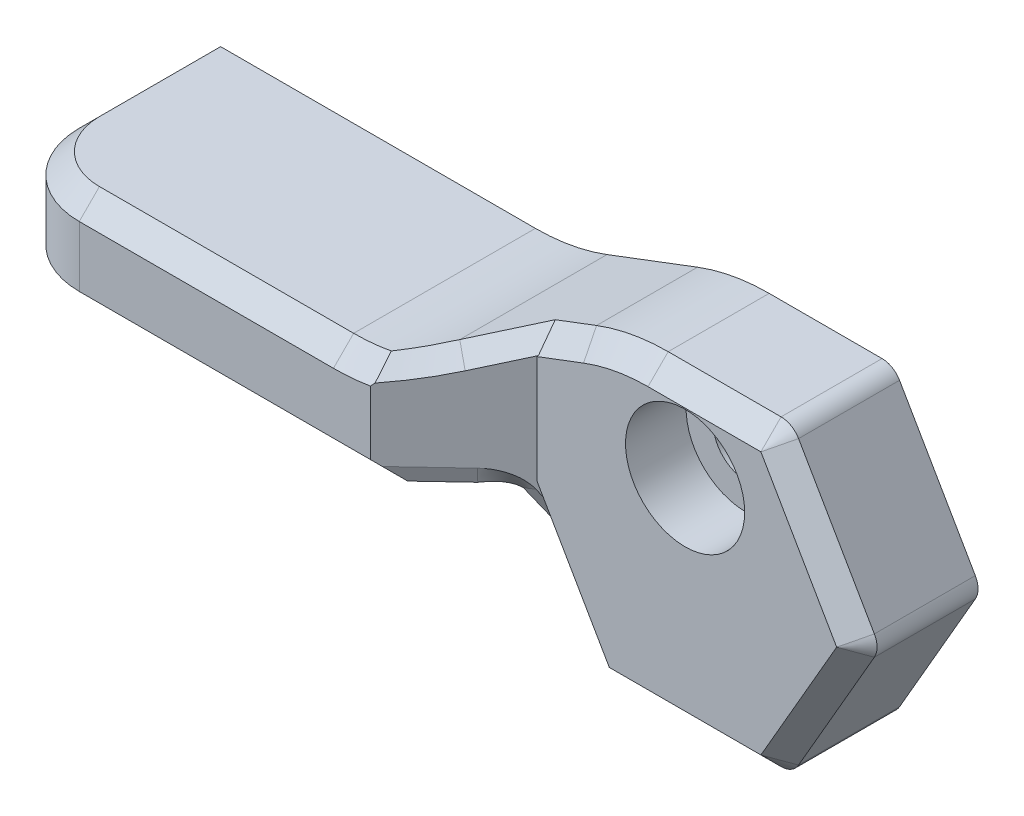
ISO-10303-21;
HEADER;
FILE_DESCRIPTION(('STEP AP214'),'2;1');
FILE_NAME('part.step','',(''),(''),'','','');
FILE_SCHEMA(('AUTOMOTIVE_DESIGN { 1 0 10303 214 1 1 1 1 }'));
ENDSEC;
DATA;
#1=APPLICATION_CONTEXT('core data for automotive mechanical design processes');
#2=APPLICATION_PROTOCOL_DEFINITION('international standard','automotive_design',2000,#1);
#3=PRODUCT_CONTEXT('',#1,'mechanical');
#4=PRODUCT('Part','Part','',(#3));
#5=PRODUCT_RELATED_PRODUCT_CATEGORY('part','',(#4));
#6=PRODUCT_DEFINITION_FORMATION('','',#4);
#7=PRODUCT_DEFINITION_CONTEXT('part definition',#1,'design');
#8=PRODUCT_DEFINITION('design','',#6,#7);
#9=PRODUCT_DEFINITION_SHAPE('','',#8);
#10=(LENGTH_UNIT() NAMED_UNIT(*) SI_UNIT(.MILLI.,.METRE.));
#11=(NAMED_UNIT(*) PLANE_ANGLE_UNIT() SI_UNIT($,.RADIAN.));
#12=(NAMED_UNIT(*) SI_UNIT($,.STERADIAN.) SOLID_ANGLE_UNIT());
#13=UNCERTAINTY_MEASURE_WITH_UNIT(LENGTH_MEASURE(1.E-05),#10,'distance_accuracy_value','');
#14=(GEOMETRIC_REPRESENTATION_CONTEXT(3) GLOBAL_UNCERTAINTY_ASSIGNED_CONTEXT((#13)) GLOBAL_UNIT_ASSIGNED_CONTEXT((#10,
#11,#12)) REPRESENTATION_CONTEXT('',''));
#15=CARTESIAN_POINT('',(0.,0.,0.));
#16=DIRECTION('',(0.,0.,1.));
#17=DIRECTION('',(1.,0.,0.));
#18=AXIS2_PLACEMENT_3D('',#15,#16,#17);
#19=CARTESIAN_POINT('',(0.,3.5,0.));
#20=DIRECTION('',(0.,0.,1.));
#21=DIRECTION('',(1.,0.,0.));
#22=AXIS2_PLACEMENT_3D('',#19,#20,#21);
#23=CYLINDRICAL_SURFACE('',#22,1.6);
#24=CARTESIAN_POINT('',(0.,3.5,0.));
#25=DIRECTION('',(0.,0.,1.));
#26=DIRECTION('',(1.,0.,0.));
#27=AXIS2_PLACEMENT_3D('',#24,#25,#26);
#28=CIRCLE('',#27,1.6);
#29=CARTESIAN_POINT('',(1.6,3.5,0.));
#30=VERTEX_POINT('',#29);
#31=EDGE_CURVE('E721',#30,#30,#28,.T.);
#32=ORIENTED_EDGE('',*,*,#31,.F.);
#33=EDGE_LOOP('',(#32));
#34=FACE_BOUND('',#33,.T.);
#35=CARTESIAN_POINT('',(0.,3.5,3.));
#36=DIRECTION('',(0.,0.,1.));
#37=DIRECTION('',(1.,0.,0.));
#38=AXIS2_PLACEMENT_3D('',#35,#36,#37);
#39=CIRCLE('',#38,1.6);
#40=CARTESIAN_POINT('',(1.6,3.5,3.));
#41=VERTEX_POINT('',#40);
#42=EDGE_CURVE('E726',#41,#41,#39,.F.);
#43=ORIENTED_EDGE('',*,*,#42,.F.);
#44=EDGE_LOOP('',(#43));
#45=FACE_BOUND('',#44,.T.);
#46=ADVANCED_FACE('F34',(#34,#45),#23,.F.);
#47=CARTESIAN_POINT('',(-11.5799906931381,4.5,10.));
#48=DIRECTION('',(0.35461398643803,-0.935012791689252,0.));
#49=DIRECTION('',(0.935012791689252,0.35461398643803,0.));
#50=AXIS2_PLACEMENT_3D('',#47,#48,#49);
#51=PLANE('',#50);
#52=DIRECTION('',(0.,0.,-1.));
#53=VECTOR('',#52,1.);
#54=CARTESIAN_POINT('',(-9.86646913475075,5.14987208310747,10.));
#55=LINE('',#54,#53);
#56=CARTESIAN_POINT('',(-9.86646913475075,5.14987208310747,0.));
#57=VERTEX_POINT('',#56);
#58=CARTESIAN_POINT('',(-9.86646913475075,5.14987208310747,7.29076062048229));
#59=VERTEX_POINT('',#58);
#60=EDGE_CURVE('E673',#57,#59,#55,.F.);
#61=ORIENTED_EDGE('',*,*,#60,.T.);
#62=DIRECTION('',(0.702167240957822,0.266304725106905,-0.660335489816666));
#63=VECTOR('',#62,1.);
#64=CARTESIAN_POINT('',(-12.0890037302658,4.30695115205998,9.38088728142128));
#65=LINE('',#64,#63);
#66=CARTESIAN_POINT('',(-7.43059057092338,6.07370608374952,5.00000000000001));
#67=VERTEX_POINT('',#66);
#68=EDGE_CURVE('E409',#59,#67,#65,.T.);
#69=ORIENTED_EDGE('',*,*,#68,.T.);
#70=DIRECTION('',(0.935012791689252,0.35461398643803,0.));
#71=VECTOR('',#70,1.);
#72=CARTESIAN_POINT('',(-11.5799906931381,4.5,5.00000000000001));
#73=LINE('',#72,#71);
#74=CARTESIAN_POINT('',(-5.38339453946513,6.85012791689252,5.00000000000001));
#75=VERTEX_POINT('',#74);
#76=EDGE_CURVE('E408',#67,#75,#73,.T.);
#77=ORIENTED_EDGE('',*,*,#76,.T.);
#78=DIRECTION('',(0.,0.,-1.));
#79=VECTOR('',#78,1.);
#80=CARTESIAN_POINT('',(-5.38339453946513,6.85012791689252,10.));
#81=LINE('',#80,#79);
#82=CARTESIAN_POINT('',(-5.38339453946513,6.85012791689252,0.));
#83=VERTEX_POINT('',#82);
#84=EDGE_CURVE('E677',#75,#83,#81,.T.);
#85=ORIENTED_EDGE('',*,*,#84,.T.);
#86=DIRECTION('',(-0.935012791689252,-0.35461398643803,0.));
#87=VECTOR('',#86,1.);
#88=CARTESIAN_POINT('',(-11.5799906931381,4.5,0.));
#89=LINE('',#88,#87);
#90=EDGE_CURVE('E712',#83,#57,#89,.T.);
#91=ORIENTED_EDGE('',*,*,#90,.T.);
#92=EDGE_LOOP('',(#61,#69,#77,#85,#91));
#93=FACE_BOUND('',#92,.T.);
#94=ADVANCED_FACE('F311',(#93),#51,.F.);
#95=CARTESIAN_POINT('',(-30.,4.5,10.));
#96=DIRECTION('',(0.,-1.,0.));
#97=DIRECTION('',(0.,0.,-1.));
#98=AXIS2_PLACEMENT_3D('',#95,#96,#97);
#99=PLANE('',#98);
#100=DIRECTION('',(-1.,0.,0.));
#101=VECTOR('',#100,1.);
#102=CARTESIAN_POINT('',(-30.,4.5,0.));
#103=LINE('',#102,#101);
#104=CARTESIAN_POINT('',(-13.4126089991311,4.5,0.));
#105=VERTEX_POINT('',#104);
#106=CARTESIAN_POINT('',(-29.,4.5,0.));
#107=VERTEX_POINT('',#106);
#108=EDGE_CURVE('E711',#105,#107,#103,.T.);
#109=ORIENTED_EDGE('',*,*,#108,.T.);
#110=DIRECTION('',(0.,0.,1.));
#111=VECTOR('',#110,1.);
#112=CARTESIAN_POINT('',(-29.,4.5,10.));
#113=LINE('',#112,#111);
#114=CARTESIAN_POINT('',(-29.,4.5,6.));
#115=VERTEX_POINT('',#114);
#116=EDGE_CURVE('E663',#107,#115,#113,.T.);
#117=ORIENTED_EDGE('',*,*,#116,.T.);
#118=CARTESIAN_POINT('',(-26.,4.5,6.));
#119=DIRECTION('',(0.,-1.,0.));
#120=DIRECTION('',(0.,0.,-1.));
#121=AXIS2_PLACEMENT_3D('',#118,#119,#120);
#122=CIRCLE('',#121,2.99999999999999);
#123=CARTESIAN_POINT('',(-26.,4.5,9.));
#124=VERTEX_POINT('',#123);
#125=EDGE_CURVE('E661',#115,#124,#122,.F.);
#126=ORIENTED_EDGE('',*,*,#125,.T.);
#127=DIRECTION('',(1.,0.,0.));
#128=VECTOR('',#127,1.);
#129=CARTESIAN_POINT('',(-13.4126089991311,4.5,9.));
#130=LINE('',#129,#128);
#131=CARTESIAN_POINT('',(-13.4126089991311,4.5,9.));
#132=VERTEX_POINT('',#131);
#133=EDGE_CURVE('E654',#124,#132,#130,.T.);
#134=ORIENTED_EDGE('',*,*,#133,.T.);
#135=DIRECTION('',(0.,0.,-1.));
#136=VECTOR('',#135,1.);
#137=CARTESIAN_POINT('',(-13.4126089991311,4.5,0.));
#138=LINE('',#137,#136);
#139=EDGE_CURVE('E740',#132,#105,#138,.T.);
#140=ORIENTED_EDGE('',*,*,#139,.T.);
#141=EDGE_LOOP('',(#109,#117,#126,#134,#140));
#142=FACE_BOUND('',#141,.T.);
#143=ADVANCED_FACE('F869',(#142),#99,.F.);
#144=CARTESIAN_POINT('',(-30.,4.5,10.));
#145=DIRECTION('',(1.,0.,0.));
#146=DIRECTION('',(0.,0.,-1.));
#147=AXIS2_PLACEMENT_3D('',#144,#145,#146);
#148=PLANE('',#147);
#149=DIRECTION('',(0.,-1.,0.));
#150=VECTOR('',#149,1.);
#151=CARTESIAN_POINT('',(-30.,4.5,6.));
#152=LINE('',#151,#150);
#153=CARTESIAN_POINT('',(-30.,0.500000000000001,6.));
#154=VERTEX_POINT('',#153);
#155=CARTESIAN_POINT('',(-30.,3.49999999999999,6.));
#156=VERTEX_POINT('',#155);
#157=EDGE_CURVE('E691',#154,#156,#152,.F.);
#158=ORIENTED_EDGE('',*,*,#157,.T.);
#159=DIRECTION('',(0.,0.,-1.));
#160=VECTOR('',#159,1.);
#161=CARTESIAN_POINT('',(-30.,3.49999999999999,10.));
#162=LINE('',#161,#160);
#163=CARTESIAN_POINT('',(-30.,3.49999999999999,0.));
#164=VERTEX_POINT('',#163);
#165=EDGE_CURVE('E652',#156,#164,#162,.T.);
#166=ORIENTED_EDGE('',*,*,#165,.T.);
#167=DIRECTION('',(0.,-1.,0.));
#168=VECTOR('',#167,1.);
#169=CARTESIAN_POINT('',(-30.,4.5,0.));
#170=LINE('',#169,#168);
#171=CARTESIAN_POINT('',(-30.,0.500000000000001,0.));
#172=VERTEX_POINT('',#171);
#173=EDGE_CURVE('E275',#164,#172,#170,.T.);
#174=ORIENTED_EDGE('',*,*,#173,.T.);
#175=DIRECTION('',(0.,0.,1.));
#176=VECTOR('',#175,1.);
#177=CARTESIAN_POINT('',(-30.,0.500000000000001,10.));
#178=LINE('',#177,#176);
#179=EDGE_CURVE('E648',#172,#154,#178,.T.);
#180=ORIENTED_EDGE('',*,*,#179,.T.);
#181=EDGE_LOOP('',(#158,#166,#174,#180));
#182=FACE_BOUND('',#181,.T.);
#183=ADVANCED_FACE('F695',(#182),#148,.F.);
#184=CARTESIAN_POINT('',(-30.,-0.500000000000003,10.));
#185=DIRECTION('',(0.,1.,0.));
#186=DIRECTION('',(0.,0.,1.));
#187=AXIS2_PLACEMENT_3D('',#184,#185,#186);
#188=PLANE('',#187);
#189=CARTESIAN_POINT('',(-26.,-0.500000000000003,6.));
#190=DIRECTION('',(0.,1.,0.));
#191=DIRECTION('',(0.,0.,1.));
#192=AXIS2_PLACEMENT_3D('',#189,#190,#191);
#193=CIRCLE('',#192,2.99999999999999);
#194=CARTESIAN_POINT('',(-26.,-0.500000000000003,8.99999999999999));
#195=VERTEX_POINT('',#194);
#196=CARTESIAN_POINT('',(-29.,-0.500000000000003,6.));
#197=VERTEX_POINT('',#196);
#198=EDGE_CURVE('E403',#195,#197,#193,.F.);
#199=ORIENTED_EDGE('',*,*,#198,.T.);
#200=DIRECTION('',(0.,0.,-1.));
#201=VECTOR('',#200,1.);
#202=CARTESIAN_POINT('',(-29.,-0.500000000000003,10.));
#203=LINE('',#202,#201);
#204=CARTESIAN_POINT('',(-29.,-0.500000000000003,0.));
#205=VERTEX_POINT('',#204);
#206=EDGE_CURVE('E291',#197,#205,#203,.T.);
#207=ORIENTED_EDGE('',*,*,#206,.T.);
#208=DIRECTION('',(1.,0.,0.));
#209=VECTOR('',#208,1.);
#210=CARTESIAN_POINT('',(-30.,-0.500000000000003,0.));
#211=LINE('',#210,#209);
#212=CARTESIAN_POINT('',(-8.9489291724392,-0.500000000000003,0.));
#213=VERTEX_POINT('',#212);
#214=EDGE_CURVE('E270',#205,#213,#211,.T.);
#215=ORIENTED_EDGE('',*,*,#214,.T.);
#216=DIRECTION('',(0.,0.,-1.));
#217=VECTOR('',#216,1.);
#218=CARTESIAN_POINT('',(-8.9489291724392,-0.500000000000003,10.));
#219=LINE('',#218,#217);
#220=CARTESIAN_POINT('',(-8.9489291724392,-0.500000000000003,7.31785616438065));
#221=VERTEX_POINT('',#220);
#222=EDGE_CURVE('E252',#213,#221,#219,.F.);
#223=ORIENTED_EDGE('',*,*,#222,.T.);
#224=DIRECTION('',(-0.72847321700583,0.,0.685074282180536));
#225=VECTOR('',#224,1.);
#226=CARTESIAN_POINT('',(-21.4587149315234,-0.500000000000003,19.0823689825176));
#227=LINE('',#226,#225);
#228=CARTESIAN_POINT('',(-10.7376355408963,-0.500000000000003,8.99999999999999));
#229=VERTEX_POINT('',#228);
#230=EDGE_CURVE('E397',#221,#229,#227,.T.);
#231=ORIENTED_EDGE('',*,*,#230,.T.);
#232=DIRECTION('',(-1.,0.,0.));
#233=VECTOR('',#232,1.);
#234=CARTESIAN_POINT('',(-26.,-0.500000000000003,8.99999999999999));
#235=LINE('',#234,#233);
#236=EDGE_CURVE('E400',#229,#195,#235,.T.);
#237=ORIENTED_EDGE('',*,*,#236,.T.);
#238=EDGE_LOOP('',(#199,#207,#215,#223,#231,#237));
#239=FACE_BOUND('',#238,.T.);
#240=ADVANCED_FACE('F639',(#239),#188,.F.);
#241=CARTESIAN_POINT('',(-8.37157890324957,-0.500000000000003,10.));
#242=DIRECTION('',(0.866025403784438,0.5,0.));
#243=DIRECTION('',(-0.5,0.866025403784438,0.));
#244=AXIS2_PLACEMENT_3D('',#241,#242,#243);
#245=PLANE('',#244);
#246=DIRECTION('',(-0.5,0.866025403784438,0.));
#247=VECTOR('',#246,1.);
#248=CARTESIAN_POINT('',(-8.37157890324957,-0.500000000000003,5.00000000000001));
#249=LINE('',#248,#247);
#250=CARTESIAN_POINT('',(-4.618802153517,-7.,5.00000000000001));
#251=VERTEX_POINT('',#250);
#252=CARTESIAN_POINT('',(-7.10358940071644,-2.69622224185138,5.00000000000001));
#253=VERTEX_POINT('',#252);
#254=EDGE_CURVE('E299',#251,#253,#249,.T.);
#255=ORIENTED_EDGE('',*,*,#254,.T.);
#256=DIRECTION('',(-0.452474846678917,0.783709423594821,0.42551856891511));
#257=VECTOR('',#256,1.);
#258=CARTESIAN_POINT('',(-9.10467129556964,0.769753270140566,6.8818670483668));
#259=LINE('',#258,#257);
#260=CARTESIAN_POINT('',(-8.08290376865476,-1.,5.92097152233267));
#261=VERTEX_POINT('',#260);
#262=EDGE_CURVE('E249',#253,#261,#259,.T.);
#263=ORIENTED_EDGE('',*,*,#262,.T.);
#264=DIRECTION('',(0.,0.,-1.));
#265=VECTOR('',#264,1.);
#266=CARTESIAN_POINT('',(-8.08290376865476,-1.,0.));
#267=LINE('',#266,#265);
#268=CARTESIAN_POINT('',(-8.08290376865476,-1.,0.));
#269=VERTEX_POINT('',#268);
#270=EDGE_CURVE('E241',#261,#269,#267,.T.);
#271=ORIENTED_EDGE('',*,*,#270,.T.);
#272=DIRECTION('',(0.5,-0.866025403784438,0.));
#273=VECTOR('',#272,1.);
#274=CARTESIAN_POINT('',(-8.37157890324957,-0.500000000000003,0.));
#275=LINE('',#274,#273);
#276=CARTESIAN_POINT('',(-4.618802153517,-7.,0.));
#277=VERTEX_POINT('',#276);
#278=EDGE_CURVE('E246',#269,#277,#275,.T.);
#279=ORIENTED_EDGE('',*,*,#278,.T.);
#280=DIRECTION('',(0.,0.,-1.));
#281=VECTOR('',#280,1.);
#282=CARTESIAN_POINT('',(-4.618802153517,-7.,10.));
#283=LINE('',#282,#281);
#284=EDGE_CURVE('E760',#277,#251,#283,.F.);
#285=ORIENTED_EDGE('',*,*,#284,.T.);
#286=EDGE_LOOP('',(#255,#263,#271,#279,#285));
#287=FACE_BOUND('',#286,.T.);
#288=ADVANCED_FACE('F243',(#287),#245,.F.);
#289=CARTESIAN_POINT('',(-4.33012701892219,-7.5,10.));
#290=DIRECTION('',(0.,1.,0.));
#291=DIRECTION('',(-1.,0.,0.));
#292=AXIS2_PLACEMENT_3D('',#289,#290,#291);
#293=PLANE('',#292);
#294=DIRECTION('',(0.,0.,-1.));
#295=VECTOR('',#294,1.);
#296=CARTESIAN_POINT('',(3.75277674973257,-7.5,10.));
#297=LINE('',#296,#295);
#298=CARTESIAN_POINT('',(3.75277674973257,-7.5,0.));
#299=VERTEX_POINT('',#298);
#300=CARTESIAN_POINT('',(3.75277674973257,-7.5,5.00000000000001));
#301=VERTEX_POINT('',#300);
#302=EDGE_CURVE('E262',#299,#301,#297,.F.);
#303=ORIENTED_EDGE('',*,*,#302,.T.);
#304=DIRECTION('',(-1.,0.,0.));
#305=VECTOR('',#304,1.);
#306=CARTESIAN_POINT('',(-4.33012701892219,-7.5,5.00000000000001));
#307=LINE('',#306,#305);
#308=CARTESIAN_POINT('',(-3.75277674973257,-7.5,5.00000000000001));
#309=VERTEX_POINT('',#308);
#310=EDGE_CURVE('E433',#301,#309,#307,.T.);
#311=ORIENTED_EDGE('',*,*,#310,.T.);
#312=DIRECTION('',(0.,0.,-1.));
#313=VECTOR('',#312,1.);
#314=CARTESIAN_POINT('',(-3.75277674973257,-7.5,10.));
#315=LINE('',#314,#313);
#316=CARTESIAN_POINT('',(-3.75277674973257,-7.5,0.));
#317=VERTEX_POINT('',#316);
#318=EDGE_CURVE('E769',#309,#317,#315,.T.);
#319=ORIENTED_EDGE('',*,*,#318,.T.);
#320=DIRECTION('',(1.,0.,0.));
#321=VECTOR('',#320,1.);
#322=CARTESIAN_POINT('',(-4.33012701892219,-7.5,0.));
#323=LINE('',#322,#321);
#324=EDGE_CURVE('E269',#317,#299,#323,.T.);
#325=ORIENTED_EDGE('',*,*,#324,.T.);
#326=EDGE_LOOP('',(#303,#311,#319,#325));
#327=FACE_BOUND('',#326,.T.);
#328=ADVANCED_FACE('F775',(#327),#293,.F.);
#329=CARTESIAN_POINT('',(4.33012701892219,-7.5,10.));
#330=DIRECTION('',(-0.866025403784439,0.5,0.));
#331=DIRECTION('',(-0.5,-0.866025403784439,0.));
#332=AXIS2_PLACEMENT_3D('',#329,#330,#331);
#333=PLANE('',#332);
#334=DIRECTION('',(0.,0.,-1.));
#335=VECTOR('',#334,1.);
#336=CARTESIAN_POINT('',(8.37157890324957,-0.499999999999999,10.));
#337=LINE('',#336,#335);
#338=CARTESIAN_POINT('',(8.37157890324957,-0.499999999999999,0.));
#339=VERTEX_POINT('',#338);
#340=CARTESIAN_POINT('',(8.37157890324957,-0.499999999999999,5.00000000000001));
#341=VERTEX_POINT('',#340);
#342=EDGE_CURVE('E757',#339,#341,#337,.F.);
#343=ORIENTED_EDGE('',*,*,#342,.T.);
#344=DIRECTION('',(-0.5,-0.866025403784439,0.));
#345=VECTOR('',#344,1.);
#346=CARTESIAN_POINT('',(4.33012701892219,-7.5,5.00000000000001));
#347=LINE('',#346,#345);
#348=CARTESIAN_POINT('',(4.61880215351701,-7.,5.00000000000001));
#349=VERTEX_POINT('',#348);
#350=EDGE_CURVE('E437',#341,#349,#347,.T.);
#351=ORIENTED_EDGE('',*,*,#350,.T.);
#352=DIRECTION('',(0.,0.,-1.));
#353=VECTOR('',#352,1.);
#354=CARTESIAN_POINT('',(4.61880215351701,-7.,10.));
#355=LINE('',#354,#353);
#356=CARTESIAN_POINT('',(4.61880215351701,-7.,0.));
#357=VERTEX_POINT('',#356);
#358=EDGE_CURVE('E753',#349,#357,#355,.T.);
#359=ORIENTED_EDGE('',*,*,#358,.T.);
#360=DIRECTION('',(0.5,0.866025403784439,0.));
#361=VECTOR('',#360,1.);
#362=CARTESIAN_POINT('',(4.33012701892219,-7.5,0.));
#363=LINE('',#362,#361);
#364=EDGE_CURVE('E273',#357,#339,#363,.T.);
#365=ORIENTED_EDGE('',*,*,#364,.T.);
#366=EDGE_LOOP('',(#343,#351,#359,#365));
#367=FACE_BOUND('',#366,.T.);
#368=ADVANCED_FACE('F807',(#367),#333,.F.);
#369=CARTESIAN_POINT('',(8.66025403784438,0.,10.));
#370=DIRECTION('',(-0.866025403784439,-0.5,0.));
#371=DIRECTION('',(0.5,-0.866025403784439,0.));
#372=AXIS2_PLACEMENT_3D('',#369,#370,#371);
#373=PLANE('',#372);
#374=DIRECTION('',(0.,0.,-1.));
#375=VECTOR('',#374,1.);
#376=CARTESIAN_POINT('',(4.618802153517,7.,10.));
#377=LINE('',#376,#375);
#378=CARTESIAN_POINT('',(4.618802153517,7.,0.));
#379=VERTEX_POINT('',#378);
#380=CARTESIAN_POINT('',(4.618802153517,7.,5.00000000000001));
#381=VERTEX_POINT('',#380);
#382=EDGE_CURVE('E748',#379,#381,#377,.F.);
#383=ORIENTED_EDGE('',*,*,#382,.T.);
#384=DIRECTION('',(0.5,-0.866025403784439,0.));
#385=VECTOR('',#384,1.);
#386=CARTESIAN_POINT('',(8.66025403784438,0.,5.00000000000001));
#387=LINE('',#386,#385);
#388=CARTESIAN_POINT('',(8.37157890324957,0.500000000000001,5.00000000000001));
#389=VERTEX_POINT('',#388);
#390=EDGE_CURVE('E441',#381,#389,#387,.T.);
#391=ORIENTED_EDGE('',*,*,#390,.T.);
#392=DIRECTION('',(0.,0.,-1.));
#393=VECTOR('',#392,1.);
#394=CARTESIAN_POINT('',(8.37157890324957,0.500000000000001,10.));
#395=LINE('',#394,#393);
#396=CARTESIAN_POINT('',(8.37157890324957,0.500000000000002,0.));
#397=VERTEX_POINT('',#396);
#398=EDGE_CURVE('E744',#389,#397,#395,.T.);
#399=ORIENTED_EDGE('',*,*,#398,.T.);
#400=DIRECTION('',(-0.5,0.866025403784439,0.));
#401=VECTOR('',#400,1.);
#402=CARTESIAN_POINT('',(8.66025403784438,0.,0.));
#403=LINE('',#402,#401);
#404=EDGE_CURVE('E281',#397,#379,#403,.T.);
#405=ORIENTED_EDGE('',*,*,#404,.T.);
#406=EDGE_LOOP('',(#383,#391,#399,#405));
#407=FACE_BOUND('',#406,.T.);
#408=ADVANCED_FACE('F881',(#407),#373,.F.);
#409=CARTESIAN_POINT('',(4.33012701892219,7.5,10.));
#410=DIRECTION('',(0.,-1.,0.));
#411=DIRECTION('',(1.,0.,0.));
#412=AXIS2_PLACEMENT_3D('',#409,#410,#411);
#413=PLANE('',#412);
#414=DIRECTION('',(0.,0.,-1.));
#415=VECTOR('',#414,1.);
#416=CARTESIAN_POINT('',(-1.83725467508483,7.5,10.));
#417=LINE('',#416,#415);
#418=CARTESIAN_POINT('',(-1.83725467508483,7.5,0.));
#419=VERTEX_POINT('',#418);
#420=CARTESIAN_POINT('',(-1.83725467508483,7.5,5.00000000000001));
#421=VERTEX_POINT('',#420);
#422=EDGE_CURVE('E683',#419,#421,#417,.F.);
#423=ORIENTED_EDGE('',*,*,#422,.T.);
#424=DIRECTION('',(1.,0.,0.));
#425=VECTOR('',#424,1.);
#426=CARTESIAN_POINT('',(4.33012701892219,7.5,5.00000000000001));
#427=LINE('',#426,#425);
#428=CARTESIAN_POINT('',(3.75277674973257,7.5,5.00000000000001));
#429=VERTEX_POINT('',#428);
#430=EDGE_CURVE('E445',#421,#429,#427,.T.);
#431=ORIENTED_EDGE('',*,*,#430,.T.);
#432=DIRECTION('',(0.,0.,-1.));
#433=VECTOR('',#432,1.);
#434=CARTESIAN_POINT('',(3.75277674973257,7.5,10.));
#435=LINE('',#434,#433);
#436=CARTESIAN_POINT('',(3.75277674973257,7.5,0.));
#437=VERTEX_POINT('',#436);
#438=EDGE_CURVE('E738',#429,#437,#435,.T.);
#439=ORIENTED_EDGE('',*,*,#438,.T.);
#440=DIRECTION('',(-1.,0.,0.));
#441=VECTOR('',#440,1.);
#442=CARTESIAN_POINT('',(4.33012701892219,7.5,0.));
#443=LINE('',#442,#441);
#444=EDGE_CURVE('E253',#437,#419,#443,.T.);
#445=ORIENTED_EDGE('',*,*,#444,.T.);
#446=EDGE_LOOP('',(#423,#431,#439,#445));
#447=FACE_BOUND('',#446,.T.);
#448=ADVANCED_FACE('F878',(#447),#413,.F.);
#449=CARTESIAN_POINT('',(0.,0.,10.));
#450=DIRECTION('',(0.,0.,1.));
#451=DIRECTION('',(1.,0.,0.));
#452=AXIS2_PLACEMENT_3D('',#449,#450,#451);
#453=PLANE('',#452);
#454=CARTESIAN_POINT('',(-13.4126089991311,14.5,10.));
#455=DIRECTION('',(0.,0.,1.));
#456=DIRECTION('',(1.,0.,0.));
#457=AXIS2_PLACEMENT_3D('',#454,#455,#456);
#458=CIRCLE('',#457,11.);
#459=CARTESIAN_POINT('',(-11.5799906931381,3.65373289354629,10.));
#460=VERTEX_POINT('',#459);
#461=CARTESIAN_POINT('',(-13.4126089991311,3.49999999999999,10.));
#462=VERTEX_POINT('',#461);
#463=EDGE_CURVE('E670',#460,#462,#458,.F.);
#464=ORIENTED_EDGE('',*,*,#463,.T.);
#465=DIRECTION('',(-1.,0.,0.));
#466=VECTOR('',#465,1.);
#467=CARTESIAN_POINT('',(-26.,3.49999999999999,10.));
#468=LINE('',#467,#466);
#469=CARTESIAN_POINT('',(-26.,3.49999999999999,10.));
#470=VERTEX_POINT('',#469);
#471=EDGE_CURVE('E672',#462,#470,#468,.T.);
#472=ORIENTED_EDGE('',*,*,#471,.T.);
#473=DIRECTION('',(0.,-1.,0.));
#474=VECTOR('',#473,1.);
#475=CARTESIAN_POINT('',(-26.,-0.500000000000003,10.));
#476=LINE('',#475,#474);
#477=CARTESIAN_POINT('',(-26.,0.500000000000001,10.));
#478=VERTEX_POINT('',#477);
#479=EDGE_CURVE('E688',#470,#478,#476,.T.);
#480=ORIENTED_EDGE('',*,*,#479,.T.);
#481=DIRECTION('',(1.,0.,0.));
#482=VECTOR('',#481,1.);
#483=CARTESIAN_POINT('',(-11.5799906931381,0.500000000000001,10.));
#484=LINE('',#483,#482);
#485=CARTESIAN_POINT('',(-11.5799906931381,0.499999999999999,10.));
#486=VERTEX_POINT('',#485);
#487=EDGE_CURVE('E668',#478,#486,#484,.T.);
#488=ORIENTED_EDGE('',*,*,#487,.T.);
#489=DIRECTION('',(0.,1.,0.));
#490=VECTOR('',#489,1.);
#491=CARTESIAN_POINT('',(-11.5799906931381,-7.5,10.));
#492=LINE('',#491,#490);
#493=EDGE_CURVE('E717',#486,#460,#492,.T.);
#494=ORIENTED_EDGE('',*,*,#493,.T.);
#495=EDGE_LOOP('',(#464,#472,#480,#488,#494));
#496=FACE_BOUND('',#495,.T.);
#497=ADVANCED_FACE('F864',(#496),#453,.T.);
#498=CARTESIAN_POINT('',(0.,0.,0.));
#499=DIRECTION('',(0.,0.,1.));
#500=DIRECTION('',(1.,0.,0.));
#501=AXIS2_PLACEMENT_3D('',#498,#499,#500);
#502=PLANE('',#501);
#503=ORIENTED_EDGE('',*,*,#31,.T.);
#504=EDGE_LOOP('',(#503));
#505=FACE_BOUND('',#504,.T.);
#506=ORIENTED_EDGE('',*,*,#173,.F.);
#507=DIRECTION('',(-0.707106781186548,-0.707106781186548,0.));
#508=VECTOR('',#507,1.);
#509=CARTESIAN_POINT('',(-30.,3.49999999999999,0.));
#510=LINE('',#509,#508);
#511=EDGE_CURVE('E651',#164,#107,#510,.F.);
#512=ORIENTED_EDGE('',*,*,#511,.T.);
#513=ORIENTED_EDGE('',*,*,#108,.F.);
#514=CARTESIAN_POINT('',(-13.4126089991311,14.5,0.));
#515=DIRECTION('',(0.,0.,1.));
#516=DIRECTION('',(1.,0.,0.));
#517=AXIS2_PLACEMENT_3D('',#514,#515,#516);
#518=CIRCLE('',#517,10.);
#519=EDGE_CURVE('E686',#105,#57,#518,.T.);
#520=ORIENTED_EDGE('',*,*,#519,.T.);
#521=ORIENTED_EDGE('',*,*,#90,.F.);
#522=CARTESIAN_POINT('',(-1.83725467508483,-2.5,0.));
#523=DIRECTION('',(0.,0.,1.));
#524=DIRECTION('',(1.,0.,0.));
#525=AXIS2_PLACEMENT_3D('',#522,#523,#524);
#526=CIRCLE('',#525,10.);
#527=EDGE_CURVE('E676',#83,#419,#526,.F.);
#528=ORIENTED_EDGE('',*,*,#527,.T.);
#529=ORIENTED_EDGE('',*,*,#444,.F.);
#530=CARTESIAN_POINT('',(3.75277674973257,6.5,0.));
#531=DIRECTION('',(0.,0.,1.));
#532=DIRECTION('',(1.,0.,0.));
#533=AXIS2_PLACEMENT_3D('',#530,#531,#532);
#534=CIRCLE('',#533,1.);
#535=EDGE_CURVE('E767',#437,#379,#534,.F.);
#536=ORIENTED_EDGE('',*,*,#535,.T.);
#537=ORIENTED_EDGE('',*,*,#404,.F.);
#538=CARTESIAN_POINT('',(7.50555349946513,0.,0.));
#539=DIRECTION('',(0.,0.,1.));
#540=DIRECTION('',(1.,0.,0.));
#541=AXIS2_PLACEMENT_3D('',#538,#539,#540);
#542=CIRCLE('',#541,1.);
#543=EDGE_CURVE('E765',#397,#339,#542,.F.);
#544=ORIENTED_EDGE('',*,*,#543,.T.);
#545=ORIENTED_EDGE('',*,*,#364,.F.);
#546=CARTESIAN_POINT('',(3.75277674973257,-6.5,0.));
#547=DIRECTION('',(0.,0.,1.));
#548=DIRECTION('',(1.,0.,0.));
#549=AXIS2_PLACEMENT_3D('',#546,#547,#548);
#550=CIRCLE('',#549,1.);
#551=EDGE_CURVE('E763',#357,#299,#550,.F.);
#552=ORIENTED_EDGE('',*,*,#551,.T.);
#553=ORIENTED_EDGE('',*,*,#324,.F.);
#554=CARTESIAN_POINT('',(-3.75277674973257,-6.5,0.));
#555=DIRECTION('',(0.,0.,1.));
#556=DIRECTION('',(1.,0.,0.));
#557=AXIS2_PLACEMENT_3D('',#554,#555,#556);
#558=CIRCLE('',#557,1.);
#559=EDGE_CURVE('E268',#317,#277,#558,.F.);
#560=ORIENTED_EDGE('',*,*,#559,.T.);
#561=ORIENTED_EDGE('',*,*,#278,.F.);
#562=CARTESIAN_POINT('',(-8.9489291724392,-1.5,0.));
#563=DIRECTION('',(0.,0.,1.));
#564=DIRECTION('',(1.,0.,0.));
#565=AXIS2_PLACEMENT_3D('',#562,#563,#564);
#566=CIRCLE('',#565,1.);
#567=EDGE_CURVE('E257',#269,#213,#566,.T.);
#568=ORIENTED_EDGE('',*,*,#567,.T.);
#569=ORIENTED_EDGE('',*,*,#214,.F.);
#570=DIRECTION('',(0.707106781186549,-0.707106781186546,0.));
#571=VECTOR('',#570,1.);
#572=CARTESIAN_POINT('',(-29.,-0.500000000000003,0.));
#573=LINE('',#572,#571);
#574=EDGE_CURVE('E649',#205,#172,#573,.F.);
#575=ORIENTED_EDGE('',*,*,#574,.T.);
#576=EDGE_LOOP('',(#506,#512,#513,#520,#521,#528,#529,#536,#537,#544,#545,#552,#553,#560,#561,
#568,#569,#575));
#577=FACE_BOUND('',#576,.T.);
#578=ADVANCED_FACE('F265',(#505,#577),#502,.F.);
#579=CARTESIAN_POINT('',(-8.9489291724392,-1.5,10.));
#580=DIRECTION('',(0.,0.,1.));
#581=DIRECTION('',(1.,0.,0.));
#582=AXIS2_PLACEMENT_3D('',#579,#580,#581);
#583=CYLINDRICAL_SURFACE('',#582,1.);
#584=ORIENTED_EDGE('',*,*,#270,.F.);
#585=CARTESIAN_POINT('',(-8.9489291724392,-0.500000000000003,7.31785616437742));
#586=CARTESIAN_POINT('',(-8.90529589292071,-0.499999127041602,7.24747640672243));
#587=CARTESIAN_POINT('',(-8.8616629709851,-0.502859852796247,7.17709722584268));
#588=CARTESIAN_POINT('',(-8.7751429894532,-0.514250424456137,7.03754192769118));
#589=CARTESIAN_POINT('',(-8.73225663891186,-0.522781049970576,6.96836695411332));
#590=CARTESIAN_POINT('',(-8.6479636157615,-0.545367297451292,6.83240370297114));
#591=CARTESIAN_POINT('',(-8.60655763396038,-0.559422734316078,6.76561653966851));
#592=CARTESIAN_POINT('',(-8.52593384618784,-0.592818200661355,6.63557170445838));
#593=CARTESIAN_POINT('',(-8.48671670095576,-0.612157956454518,6.57231509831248));
#594=CARTESIAN_POINT('',(-8.41114164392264,-0.65579123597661,6.45041378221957));
#595=CARTESIAN_POINT('',(-8.37478435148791,-0.680084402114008,6.39177007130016));
#596=CARTESIAN_POINT('',(-8.30555113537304,-0.733208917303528,6.28009803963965));
#597=CARTESIAN_POINT('',(-8.27267577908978,-0.762039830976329,6.22707063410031));
#598=CARTESIAN_POINT('',(-8.21096900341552,-0.823746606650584,6.12753862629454));
#599=CARTESIAN_POINT('',(-8.18213808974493,-0.856621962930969,6.08103483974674));
#600=CARTESIAN_POINT('',(-8.12901357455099,-0.925855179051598,5.99534587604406));
#601=CARTESIAN_POINT('',(-8.10471965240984,-0.962212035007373,5.95616018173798));
#602=CARTESIAN_POINT('',(-8.08290376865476,-1.,5.92097152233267));
#603=B_SPLINE_CURVE_WITH_KNOTS('',3,(#585,#586,#587,#588,#589,#590,#591,#592,#593,#594,#595,
#596,#597,#598,#599,#600,#601,#602),.UNSPECIFIED.,.F.,.F.,(4,2,2,2,2,2,2,2,4),(1.5707963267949,
1.70169602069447,1.83259571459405,1.96349540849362,2.09439510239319,2.22529479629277,
2.35619449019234,2.48709418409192,2.61799387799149),.UNSPECIFIED.);
#604=EDGE_CURVE('E294',#261,#221,#603,.F.);
#605=ORIENTED_EDGE('',*,*,#604,.T.);
#606=ORIENTED_EDGE('',*,*,#222,.F.);
#607=ORIENTED_EDGE('',*,*,#567,.F.);
#608=EDGE_LOOP('',(#584,#605,#606,#607));
#609=FACE_BOUND('',#608,.T.);
#610=ADVANCED_FACE('F258',(#609),#583,.F.);
#611=CARTESIAN_POINT('',(-3.75277674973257,-6.5,10.));
#612=DIRECTION('',(0.,0.,-1.));
#613=DIRECTION('',(-1.,0.,0.));
#614=AXIS2_PLACEMENT_3D('',#611,#612,#613);
#615=CYLINDRICAL_SURFACE('',#614,1.);
#616=ORIENTED_EDGE('',*,*,#318,.F.);
#617=CARTESIAN_POINT('',(-3.75277674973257,-6.5,5.00000000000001));
#618=DIRECTION('',(0.,0.,-1.));
#619=DIRECTION('',(-1.,0.,0.));
#620=AXIS2_PLACEMENT_3D('',#617,#618,#619);
#621=CIRCLE('',#620,1.);
#622=EDGE_CURVE('E431',#309,#251,#621,.T.);
#623=ORIENTED_EDGE('',*,*,#622,.T.);
#624=ORIENTED_EDGE('',*,*,#284,.F.);
#625=ORIENTED_EDGE('',*,*,#559,.F.);
#626=EDGE_LOOP('',(#616,#623,#624,#625));
#627=FACE_BOUND('',#626,.T.);
#628=ADVANCED_FACE('F310',(#627),#615,.T.);
#629=CARTESIAN_POINT('',(3.75277674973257,-6.5,10.));
#630=DIRECTION('',(0.,0.,-1.));
#631=DIRECTION('',(-1.,0.,0.));
#632=AXIS2_PLACEMENT_3D('',#629,#630,#631);
#633=CYLINDRICAL_SURFACE('',#632,1.);
#634=ORIENTED_EDGE('',*,*,#358,.F.);
#635=CARTESIAN_POINT('',(3.75277674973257,-6.5,5.00000000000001));
#636=DIRECTION('',(0.,0.,-1.));
#637=DIRECTION('',(-1.,0.,0.));
#638=AXIS2_PLACEMENT_3D('',#635,#636,#637);
#639=CIRCLE('',#638,1.);
#640=EDGE_CURVE('E435',#349,#301,#639,.T.);
#641=ORIENTED_EDGE('',*,*,#640,.T.);
#642=ORIENTED_EDGE('',*,*,#302,.F.);
#643=ORIENTED_EDGE('',*,*,#551,.F.);
#644=EDGE_LOOP('',(#634,#641,#642,#643));
#645=FACE_BOUND('',#644,.T.);
#646=ADVANCED_FACE('F315',(#645),#633,.T.);
#647=CARTESIAN_POINT('',(7.50555349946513,0.,10.));
#648=DIRECTION('',(0.,0.,-1.));
#649=DIRECTION('',(-1.,0.,0.));
#650=AXIS2_PLACEMENT_3D('',#647,#648,#649);
#651=CYLINDRICAL_SURFACE('',#650,1.);
#652=ORIENTED_EDGE('',*,*,#398,.F.);
#653=CARTESIAN_POINT('',(7.50555349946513,0.,5.00000000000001));
#654=DIRECTION('',(0.,0.,-1.));
#655=DIRECTION('',(-1.,0.,0.));
#656=AXIS2_PLACEMENT_3D('',#653,#654,#655);
#657=CIRCLE('',#656,1.);
#658=EDGE_CURVE('E439',#389,#341,#657,.T.);
#659=ORIENTED_EDGE('',*,*,#658,.T.);
#660=ORIENTED_EDGE('',*,*,#342,.F.);
#661=ORIENTED_EDGE('',*,*,#543,.F.);
#662=EDGE_LOOP('',(#652,#659,#660,#661));
#663=FACE_BOUND('',#662,.T.);
#664=ADVANCED_FACE('F319',(#663),#651,.T.);
#665=CARTESIAN_POINT('',(3.75277674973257,6.5,10.));
#666=DIRECTION('',(0.,0.,-1.));
#667=DIRECTION('',(-1.,0.,0.));
#668=AXIS2_PLACEMENT_3D('',#665,#666,#667);
#669=CYLINDRICAL_SURFACE('',#668,1.);
#670=ORIENTED_EDGE('',*,*,#438,.F.);
#671=CARTESIAN_POINT('',(3.75277674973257,6.5,5.00000000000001));
#672=DIRECTION('',(0.,0.,-1.));
#673=DIRECTION('',(-1.,0.,0.));
#674=AXIS2_PLACEMENT_3D('',#671,#672,#673);
#675=CIRCLE('',#674,1.);
#676=EDGE_CURVE('E443',#429,#381,#675,.T.);
#677=ORIENTED_EDGE('',*,*,#676,.T.);
#678=ORIENTED_EDGE('',*,*,#382,.F.);
#679=ORIENTED_EDGE('',*,*,#535,.F.);
#680=EDGE_LOOP('',(#670,#677,#678,#679));
#681=FACE_BOUND('',#680,.T.);
#682=ADVANCED_FACE('F323',(#681),#669,.T.);
#683=CARTESIAN_POINT('',(-11.5799906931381,-7.5,10.));
#684=DIRECTION('',(-0.685074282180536,0.,-0.72847321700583));
#685=DIRECTION('',(-0.72847321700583,0.,0.685074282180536));
#686=AXIS2_PLACEMENT_3D('',#683,#684,#685);
#687=PLANE('',#686);
#688=ORIENTED_EDGE('',*,*,#493,.F.);
#689=DIRECTION('',(0.600972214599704,-0.565169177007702,-0.565169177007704));
#690=VECTOR('',#689,1.);
#691=CARTESIAN_POINT('',(-7.39767321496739,-3.4331550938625,6.06684490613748));
#692=LINE('',#691,#690);
#693=CARTESIAN_POINT('',(-11.2771113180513,0.215164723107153,9.71516472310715));
#694=VERTEX_POINT('',#693);
#695=EDGE_CURVE('E393',#486,#694,#692,.T.);
#696=ORIENTED_EDGE('',*,*,#695,.T.);
#697=DIRECTION('',(0.72847321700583,0.,-0.685074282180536));
#698=VECTOR('',#697,1.);
#699=CARTESIAN_POINT('',(-11.5799906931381,0.215164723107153,10.));
#700=LINE('',#699,#698);
#701=CARTESIAN_POINT('',(-8.84521073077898,0.21516472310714,7.42814509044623));
#702=VERTEX_POINT('',#701);
#703=EDGE_CURVE('E391',#694,#702,#700,.T.);
#704=ORIENTED_EDGE('',*,*,#703,.T.);
#705=CARTESIAN_POINT('',(-7.35983450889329,-0.64241763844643,6.03126044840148));
#706=CARTESIAN_POINT('',(-7.39725234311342,-0.577605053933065,6.06644910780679));
#707=CARTESIAN_POINT('',(-7.43892042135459,-0.515247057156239,6.10563480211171));
#708=CARTESIAN_POINT('',(-7.53003771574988,-0.396500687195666,6.19132376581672));
#709=CARTESIAN_POINT('',(-7.57948748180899,-0.340114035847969,6.23782755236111));
#710=CARTESIAN_POINT('',(-7.68532476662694,-0.234276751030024,6.33735956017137));
#711=CARTESIAN_POINT('',(-7.7417114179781,-0.184826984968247,6.39038696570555));
#712=CARTESIAN_POINT('',(-7.86045778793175,-0.0937096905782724,6.50205899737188));
#713=CARTESIAN_POINT('',(-7.92281653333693,-0.0520429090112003,6.56070270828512));
#714=CARTESIAN_POINT('',(-8.05244020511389,0.0227953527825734,6.68260402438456));
#715=CARTESIAN_POINT('',(-8.11970406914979,0.055966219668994,6.74586063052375));
#716=CARTESIAN_POINT('',(-8.25798714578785,0.113244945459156,6.87590546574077));
#717=CARTESIAN_POINT('',(-8.32900522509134,0.137352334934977,6.94269262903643));
#718=CARTESIAN_POINT('',(-8.47358164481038,0.176091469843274,7.07865588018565));
#719=CARTESIAN_POINT('',(-8.54713880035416,0.190722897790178,7.14783085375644));
#720=CARTESIAN_POINT('',(-8.69553482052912,0.210259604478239,7.28738615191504));
#721=CARTESIAN_POINT('',(-8.7703724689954,0.215166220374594,7.35776533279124));
#722=CARTESIAN_POINT('',(-8.84521073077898,0.21516472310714,7.42814509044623));
#723=B_SPLINE_CURVE_WITH_KNOTS('',3,(#705,#706,#707,#708,#709,#710,#711,#712,#713,#714,#715,
#716,#717,#718,#719,#720,#721,#722),.UNSPECIFIED.,.F.,.F.,(4,2,2,2,2,2,2,2,4),(1.5707963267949,
1.70169602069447,1.83259571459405,1.96349540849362,2.09439510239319,2.22529479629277,
2.35619449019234,2.48709418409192,2.61799387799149),.UNSPECIFIED.);
#724=CARTESIAN_POINT('',(-7.35983450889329,-0.642417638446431,6.03126044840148));
#725=VERTEX_POINT('',#724);
#726=EDGE_CURVE('E387',#702,#725,#723,.F.);
#727=ORIENTED_EDGE('',*,*,#726,.T.);
#728=DIRECTION('',(0.452474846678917,-0.783709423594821,-0.42551856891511));
#729=VECTOR('',#728,1.);
#730=CARTESIAN_POINT('',(-6.55620975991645,-2.03433653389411,5.27551180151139));
#731=LINE('',#730,#729);
#732=CARTESIAN_POINT('',(-7.11922737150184,-1.05916142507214,5.80498752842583));
#733=VERTEX_POINT('',#732);
#734=EDGE_CURVE('E60',#725,#733,#731,.T.);
#735=ORIENTED_EDGE('',*,*,#734,.T.);
#736=DIRECTION('',(0.258738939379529,-0.934798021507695,-0.243324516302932));
#737=VECTOR('',#736,1.);
#738=CARTESIAN_POINT('',(-6.12412760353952,-4.65435778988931,4.86917102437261));
#739=LINE('',#738,#737);
#740=CARTESIAN_POINT('',(-7.32659373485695,-0.309967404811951,6.));
#741=VERTEX_POINT('',#740);
#742=EDGE_CURVE('E45',#733,#741,#739,.F.);
#743=ORIENTED_EDGE('',*,*,#742,.T.);
#744=DIRECTION('',(0.,1.,0.));
#745=VECTOR('',#744,1.);
#746=CARTESIAN_POINT('',(-7.32659373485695,-7.5,6.));
#747=LINE('',#746,#745);
#748=CARTESIAN_POINT('',(-7.32659373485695,5.0436439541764,6.));
#749=VERTEX_POINT('',#748);
#750=EDGE_CURVE('E718',#741,#749,#747,.T.);
#751=ORIENTED_EDGE('',*,*,#750,.T.);
#752=DIRECTION('',(-0.512802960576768,-0.71025736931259,0.482252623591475));
#753=VECTOR('',#752,1.);
#754=CARTESIAN_POINT('',(-14.0029706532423,-4.20346706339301,12.2786304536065));
#755=LINE('',#754,#753);
#756=CARTESIAN_POINT('',(-7.29473801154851,5.08776570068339,5.97004208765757));
#757=VERTEX_POINT('',#756);
#758=EDGE_CURVE('E12',#749,#757,#755,.F.);
#759=ORIENTED_EDGE('',*,*,#758,.T.);
#760=DIRECTION('',(-0.702167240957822,-0.266304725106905,0.660335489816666));
#761=VECTOR('',#760,1.);
#762=CARTESIAN_POINT('',(-13.6298802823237,2.68509263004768,11.9277670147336));
#763=LINE('',#762,#761);
#764=CARTESIAN_POINT('',(-9.16346023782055,4.37903204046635,7.72743482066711));
#765=VERTEX_POINT('',#764);
#766=EDGE_CURVE('E53',#757,#765,#763,.T.);
#767=ORIENTED_EDGE('',*,*,#766,.T.);
#768=CARTESIAN_POINT('',(-11.7038894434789,3.75369674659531,10.1165174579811));
#769=CARTESIAN_POINT('',(-10.8359496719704,3.8584251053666,9.3002853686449));
#770=CARTESIAN_POINT('',(-9.98084231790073,4.0689126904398,8.49612120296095));
#771=CARTESIAN_POINT('',(-9.16346023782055,4.37903204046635,7.72743482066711));
#772=B_SPLINE_CURVE_WITH_KNOTS('',3,(#768,#769,#770,#771),.UNSPECIFIED.,.F.,.F.,(4,4),
(4.34988778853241,4.59218002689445),.UNSPECIFIED.);
#773=CARTESIAN_POINT('',(-11.4634377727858,3.78546118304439,9.89039074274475));
#774=VERTEX_POINT('',#773);
#775=EDGE_CURVE('E355',#765,#774,#772,.F.);
#776=ORIENTED_EDGE('',*,*,#775,.T.);
#777=CARTESIAN_POINT('',(-116.918796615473,14.5,109.063225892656));
#778=DIRECTION('',(-0.685074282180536,0.,-0.72847321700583));
#779=DIRECTION('',(-0.72847321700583,0.,0.685074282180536));
#780=AXIS2_PLACEMENT_3D('',#777,#778,#779);
#781=ELLIPSE('',#780,151.087539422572,37.4216891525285);
#782=EDGE_CURVE('E388',#774,#460,#781,.T.);
#783=ORIENTED_EDGE('',*,*,#782,.T.);
#784=EDGE_LOOP('',(#688,#696,#704,#727,#735,#743,#751,#759,#767,#776,#783));
#785=FACE_BOUND('',#784,.T.);
#786=ADVANCED_FACE('F327',(#785),#687,.F.);
#787=CARTESIAN_POINT('',(-7.32659373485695,-7.5,6.));
#788=DIRECTION('',(0.,0.,-1.));
#789=DIRECTION('',(-1.,0.,0.));
#790=AXIS2_PLACEMENT_3D('',#787,#788,#789);
#791=PLANE('',#790);
#792=CARTESIAN_POINT('',(0.,3.5,6.));
#793=DIRECTION('',(0.,0.,1.));
#794=DIRECTION('',(1.,0.,0.));
#795=AXIS2_PLACEMENT_3D('',#792,#793,#794);
#796=CIRCLE('',#795,2.95);
#797=CARTESIAN_POINT('',(2.95,3.5,6.));
#798=VERTEX_POINT('',#797);
#799=EDGE_CURVE('E507',#798,#798,#796,.T.);
#800=ORIENTED_EDGE('',*,*,#799,.F.);
#801=EDGE_LOOP('',(#800));
#802=FACE_BOUND('',#801,.T.);
#803=ORIENTED_EDGE('',*,*,#750,.F.);
#804=DIRECTION('',(0.5,-0.866025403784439,0.));
#805=VECTOR('',#804,1.);
#806=CARTESIAN_POINT('',(-4.21321829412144,-5.70249185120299,6.));
#807=LINE('',#806,#805);
#808=CARTESIAN_POINT('',(-3.75277674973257,-6.5,6.));
#809=VERTEX_POINT('',#808);
#810=EDGE_CURVE('E429',#741,#809,#807,.T.);
#811=ORIENTED_EDGE('',*,*,#810,.T.);
#812=DIRECTION('',(1.,0.,0.));
#813=VECTOR('',#812,1.);
#814=CARTESIAN_POINT('',(-7.32659373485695,-6.5,6.));
#815=LINE('',#814,#813);
#816=CARTESIAN_POINT('',(3.75277674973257,-6.5,6.));
#817=VERTEX_POINT('',#816);
#818=EDGE_CURVE('E427',#809,#817,#815,.T.);
#819=ORIENTED_EDGE('',*,*,#818,.T.);
#820=DIRECTION('',(0.5,0.866025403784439,0.));
#821=VECTOR('',#820,1.);
#822=CARTESIAN_POINT('',(0.54992142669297,-12.047508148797,6.));
#823=LINE('',#822,#821);
#824=CARTESIAN_POINT('',(7.50555349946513,0.,6.));
#825=VERTEX_POINT('',#824);
#826=EDGE_CURVE('E425',#817,#825,#823,.T.);
#827=ORIENTED_EDGE('',*,*,#826,.T.);
#828=DIRECTION('',(-0.5,0.866025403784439,0.));
#829=VECTOR('',#828,1.);
#830=CARTESIAN_POINT('',(7.04511195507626,0.797508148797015,6.));
#831=LINE('',#830,#829);
#832=CARTESIAN_POINT('',(3.75277674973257,6.5,6.));
#833=VERTEX_POINT('',#832);
#834=EDGE_CURVE('E423',#825,#833,#831,.T.);
#835=ORIENTED_EDGE('',*,*,#834,.T.);
#836=DIRECTION('',(-1.,0.,0.));
#837=VECTOR('',#836,1.);
#838=CARTESIAN_POINT('',(-7.32659373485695,6.5,6.));
#839=LINE('',#838,#837);
#840=CARTESIAN_POINT('',(-1.83725467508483,6.5,6.));
#841=VERTEX_POINT('',#840);
#842=EDGE_CURVE('E421',#833,#841,#839,.T.);
#843=ORIENTED_EDGE('',*,*,#842,.T.);
#844=CARTESIAN_POINT('',(-1.83725467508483,-2.5,6.));
#845=DIRECTION('',(0.,0.,-1.));
#846=DIRECTION('',(-1.,0.,0.));
#847=AXIS2_PLACEMENT_3D('',#844,#845,#846);
#848=CIRCLE('',#847,9.);
#849=CARTESIAN_POINT('',(-5.0287805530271,5.91511512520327,6.));
#850=VERTEX_POINT('',#849);
#851=EDGE_CURVE('E419',#841,#850,#848,.F.);
#852=ORIENTED_EDGE('',*,*,#851,.T.);
#853=DIRECTION('',(-0.935012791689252,-0.35461398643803,0.));
#854=VECTOR('',#853,1.);
#855=CARTESIAN_POINT('',(-11.4856723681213,3.46626718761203,6.));
#856=LINE('',#855,#854);
#857=EDGE_CURVE('E415',#850,#749,#856,.T.);
#858=ORIENTED_EDGE('',*,*,#857,.T.);
#859=EDGE_LOOP('',(#803,#811,#819,#827,#835,#843,#852,#858));
#860=FACE_BOUND('',#859,.T.);
#861=ADVANCED_FACE('F371',(#802,#860),#791,.F.);
#862=CARTESIAN_POINT('',(0.,3.5,3.));
#863=DIRECTION('',(0.,0.,1.));
#864=DIRECTION('',(1.,0.,0.));
#865=AXIS2_PLACEMENT_3D('',#862,#863,#864);
#866=PLANE('',#865);
#867=CARTESIAN_POINT('',(0.,3.5,3.));
#868=DIRECTION('',(0.,0.,1.));
#869=DIRECTION('',(1.,0.,0.));
#870=AXIS2_PLACEMENT_3D('',#867,#868,#869);
#871=CIRCLE('',#870,2.95);
#872=CARTESIAN_POINT('',(2.95,3.5,3.));
#873=VERTEX_POINT('',#872);
#874=EDGE_CURVE('E729',#873,#873,#871,.T.);
#875=ORIENTED_EDGE('',*,*,#874,.T.);
#876=EDGE_LOOP('',(#875));
#877=FACE_BOUND('',#876,.T.);
#878=ORIENTED_EDGE('',*,*,#42,.T.);
#879=EDGE_LOOP('',(#878));
#880=FACE_BOUND('',#879,.T.);
#881=ADVANCED_FACE('F973',(#877,#880),#866,.T.);
#882=CARTESIAN_POINT('',(0.,3.5,3.));
#883=DIRECTION('',(0.,0.,1.));
#884=DIRECTION('',(1.,0.,0.));
#885=AXIS2_PLACEMENT_3D('',#882,#883,#884);
#886=CYLINDRICAL_SURFACE('',#885,2.95);
#887=ORIENTED_EDGE('',*,*,#874,.F.);
#888=EDGE_LOOP('',(#887));
#889=FACE_BOUND('',#888,.T.);
#890=ORIENTED_EDGE('',*,*,#799,.T.);
#891=EDGE_LOOP('',(#890));
#892=FACE_BOUND('',#891,.T.);
#893=ADVANCED_FACE('F334',(#889,#892),#886,.F.);
#894=CARTESIAN_POINT('',(-13.4126089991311,14.5,10.));
#895=DIRECTION('',(0.,0.,1.));
#896=DIRECTION('',(1.,0.,0.));
#897=AXIS2_PLACEMENT_3D('',#894,#895,#896);
#898=CYLINDRICAL_SURFACE('',#897,10.);
#899=ORIENTED_EDGE('',*,*,#139,.F.);
#900=CARTESIAN_POINT('',(-13.4126089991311,14.5,9.));
#901=DIRECTION('',(0.,0.,1.));
#902=DIRECTION('',(1.,0.,0.));
#903=AXIS2_PLACEMENT_3D('',#900,#901,#902);
#904=CIRCLE('',#903,10.);
#905=CARTESIAN_POINT('',(-11.5455608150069,4.67583942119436,8.99999963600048));
#906=VERTEX_POINT('',#905);
#907=EDGE_CURVE('E343',#132,#906,#904,.T.);
#908=ORIENTED_EDGE('',*,*,#907,.T.);
#909=CARTESIAN_POINT('',(-9.86646913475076,5.14987208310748,7.29076062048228));
#910=CARTESIAN_POINT('',(-10.6215972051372,4.86337225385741,8.05944700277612));
#911=CARTESIAN_POINT('',(-11.4115772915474,4.66891596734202,8.86361116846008));
#912=CARTESIAN_POINT('',(-12.213412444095,4.57216400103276,9.67984325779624));
#913=B_SPLINE_CURVE_WITH_KNOTS('',3,(#909,#910,#911,#912),.UNSPECIFIED.,.F.,.F.,(4,4),
(4.34988778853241,4.59218002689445),.UNSPECIFIED.);
#914=EDGE_CURVE('E350',#906,#59,#913,.F.);
#915=ORIENTED_EDGE('',*,*,#914,.T.);
#916=ORIENTED_EDGE('',*,*,#60,.F.);
#917=ORIENTED_EDGE('',*,*,#519,.F.);
#918=EDGE_LOOP('',(#899,#908,#915,#916,#917));
#919=FACE_BOUND('',#918,.T.);
#920=ADVANCED_FACE('F329',(#919),#898,.F.);
#921=CARTESIAN_POINT('',(-1.83725467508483,-2.5,10.));
#922=DIRECTION('',(0.,0.,-1.));
#923=DIRECTION('',(-1.,0.,0.));
#924=AXIS2_PLACEMENT_3D('',#921,#922,#923);
#925=CYLINDRICAL_SURFACE('',#924,10.);
#926=ORIENTED_EDGE('',*,*,#84,.F.);
#927=CARTESIAN_POINT('',(-1.83725467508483,-2.5,5.00000000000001));
#928=DIRECTION('',(0.,0.,-1.));
#929=DIRECTION('',(-1.,0.,0.));
#930=AXIS2_PLACEMENT_3D('',#927,#928,#929);
#931=CIRCLE('',#930,10.);
#932=EDGE_CURVE('E447',#75,#421,#931,.T.);
#933=ORIENTED_EDGE('',*,*,#932,.T.);
#934=ORIENTED_EDGE('',*,*,#422,.F.);
#935=ORIENTED_EDGE('',*,*,#527,.F.);
#936=EDGE_LOOP('',(#926,#933,#934,#935));
#937=FACE_BOUND('',#936,.T.);
#938=ADVANCED_FACE('F333',(#937),#925,.T.);
#939=CARTESIAN_POINT('',(-26.,0.,6.));
#940=DIRECTION('',(0.,1.,0.));
#941=DIRECTION('',(0.,0.,1.));
#942=AXIS2_PLACEMENT_3D('',#939,#940,#941);
#943=CYLINDRICAL_SURFACE('',#942,4.);
#944=ORIENTED_EDGE('',*,*,#479,.F.);
#945=CARTESIAN_POINT('',(-26.,3.49999999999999,6.));
#946=DIRECTION('',(0.,-1.,0.));
#947=DIRECTION('',(0.,0.,-1.));
#948=AXIS2_PLACEMENT_3D('',#945,#946,#947);
#949=CIRCLE('',#948,4.);
#950=EDGE_CURVE('E666',#470,#156,#949,.T.);
#951=ORIENTED_EDGE('',*,*,#950,.T.);
#952=ORIENTED_EDGE('',*,*,#157,.F.);
#953=CARTESIAN_POINT('',(-26.,0.500000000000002,6.));
#954=DIRECTION('',(0.,1.,0.));
#955=DIRECTION('',(0.,0.,1.));
#956=AXIS2_PLACEMENT_3D('',#953,#954,#955);
#957=CIRCLE('',#956,4.);
#958=EDGE_CURVE('E644',#154,#478,#957,.T.);
#959=ORIENTED_EDGE('',*,*,#958,.T.);
#960=EDGE_LOOP('',(#944,#951,#952,#959));
#961=FACE_BOUND('',#960,.T.);
#962=ADVANCED_FACE('F699',(#961),#943,.T.);
#963=CARTESIAN_POINT('',(-29.,-0.500000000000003,10.));
#964=DIRECTION('',(0.707106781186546,0.707106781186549,0.));
#965=DIRECTION('',(0.,0.,-1.));
#966=AXIS2_PLACEMENT_3D('',#963,#964,#965);
#967=PLANE('',#966);
#968=ORIENTED_EDGE('',*,*,#574,.F.);
#969=ORIENTED_EDGE('',*,*,#206,.F.);
#970=DIRECTION('',(0.707106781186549,-0.707106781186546,0.));
#971=VECTOR('',#970,1.);
#972=CARTESIAN_POINT('',(-30.,0.500000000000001,6.));
#973=LINE('',#972,#971);
#974=EDGE_CURVE('E504',#154,#197,#973,.T.);
#975=ORIENTED_EDGE('',*,*,#974,.F.);
#976=ORIENTED_EDGE('',*,*,#179,.F.);
#977=EDGE_LOOP('',(#968,#969,#975,#976));
#978=FACE_BOUND('',#977,.T.);
#979=ADVANCED_FACE('F36',(#978),#967,.F.);
#980=CARTESIAN_POINT('',(-26.,-0.500000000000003,6.));
#981=DIRECTION('',(0.,1.,0.));
#982=DIRECTION('',(0.,0.,1.));
#983=AXIS2_PLACEMENT_3D('',#980,#981,#982);
#984=CONICAL_SURFACE('',#983,2.99999999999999,0.78539816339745);
#985=ORIENTED_EDGE('',*,*,#974,.T.);
#986=ORIENTED_EDGE('',*,*,#198,.F.);
#987=DIRECTION('',(0.,-0.707106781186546,-0.707106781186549));
#988=VECTOR('',#987,1.);
#989=CARTESIAN_POINT('',(-26.,0.500000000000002,10.));
#990=LINE('',#989,#988);
#991=EDGE_CURVE('E500',#478,#195,#990,.T.);
#992=ORIENTED_EDGE('',*,*,#991,.F.);
#993=ORIENTED_EDGE('',*,*,#958,.F.);
#994=EDGE_LOOP('',(#985,#986,#992,#993));
#995=FACE_BOUND('',#994,.T.);
#996=ADVANCED_FACE('F641',(#995),#984,.T.);
#997=CARTESIAN_POINT('',(0.,0.500000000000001,10.));
#998=DIRECTION('',(0.,-0.707106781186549,0.707106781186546));
#999=DIRECTION('',(-1.,0.,0.));
#1000=AXIS2_PLACEMENT_3D('',#997,#998,#999);
#1001=PLANE('',#1000);
#1002=ORIENTED_EDGE('',*,*,#991,.T.);
#1003=ORIENTED_EDGE('',*,*,#236,.F.);
#1004=DIRECTION('',(-0.470632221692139,0.623901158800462,0.623901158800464));
#1005=VECTOR('',#1004,1.);
#1006=CARTESIAN_POINT('',(-16.0727634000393,6.57259788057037,16.0725978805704));
#1007=LINE('',#1006,#1005);
#1008=EDGE_CURVE('E497',#694,#229,#1007,.F.);
#1009=ORIENTED_EDGE('',*,*,#1008,.F.);
#1010=ORIENTED_EDGE('',*,*,#695,.F.);
#1011=ORIENTED_EDGE('',*,*,#487,.F.);
#1012=EDGE_LOOP('',(#1002,#1003,#1009,#1010,#1011));
#1013=FACE_BOUND('',#1012,.T.);
#1014=ADVANCED_FACE('F636',(#1013),#1001,.T.);
#1015=CARTESIAN_POINT('',(-21.4587149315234,-0.500000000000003,19.0823689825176));
#1016=DIRECTION('',(-0.67022086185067,0.207105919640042,-0.712678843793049));
#1017=DIRECTION('',(-0.72847321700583,0.,0.685074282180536));
#1018=AXIS2_PLACEMENT_3D('',#1015,#1016,#1017);
#1019=PLANE('',#1018);
#1020=ORIENTED_EDGE('',*,*,#1008,.T.);
#1021=ORIENTED_EDGE('',*,*,#230,.F.);
#1022=CARTESIAN_POINT('',(-8.84521073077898,0.21516472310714,7.42814509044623));
#1023=CARTESIAN_POINT('',(-8.9489291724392,-0.500000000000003,7.31785616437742));
#1024=B_SPLINE_CURVE_WITH_KNOTS('',1,(#1022,#1023),.UNSPECIFIED.,.F.,.F.,(2,2),(0.,1.),.UNSPECIFIED.);
#1025=EDGE_CURVE('E501',#702,#221,#1024,.T.);
#1026=ORIENTED_EDGE('',*,*,#1025,.F.);
#1027=ORIENTED_EDGE('',*,*,#703,.F.);
#1028=EDGE_LOOP('',(#1020,#1021,#1026,#1027));
#1029=FACE_BOUND('',#1028,.T.);
#1030=ADVANCED_FACE('F589',(#1029),#1019,.F.);
#1031=CARTESIAN_POINT('',(-8.84521073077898,0.21516472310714,7.42814509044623));
#1032=CARTESIAN_POINT('',(-8.7703724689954,0.215166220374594,7.35776533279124));
#1033=CARTESIAN_POINT('',(-8.69553482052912,0.210259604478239,7.28738615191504));
#1034=CARTESIAN_POINT('',(-8.54713880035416,0.190722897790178,7.14783085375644));
#1035=CARTESIAN_POINT('',(-8.47358164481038,0.176091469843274,7.07865588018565));
#1036=CARTESIAN_POINT('',(-8.32900522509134,0.137352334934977,6.94269262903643));
#1037=CARTESIAN_POINT('',(-8.25798714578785,0.113244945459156,6.87590546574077));
#1038=CARTESIAN_POINT('',(-8.11970406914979,0.055966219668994,6.74586063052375));
#1039=CARTESIAN_POINT('',(-8.05244020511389,0.0227953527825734,6.68260402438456));
#1040=CARTESIAN_POINT('',(-7.92281653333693,-0.0520429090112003,6.56070270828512));
#1041=CARTESIAN_POINT('',(-7.86045778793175,-0.0937096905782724,6.50205899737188));
#1042=CARTESIAN_POINT('',(-7.7417114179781,-0.184826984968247,6.39038696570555));
#1043=CARTESIAN_POINT('',(-7.68532476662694,-0.234276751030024,6.33735956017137));
#1044=CARTESIAN_POINT('',(-7.57948748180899,-0.340114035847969,6.23782755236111));
#1045=CARTESIAN_POINT('',(-7.53003771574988,-0.396500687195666,6.19132376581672));
#1046=CARTESIAN_POINT('',(-7.43892042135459,-0.515247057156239,6.10563480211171));
#1047=CARTESIAN_POINT('',(-7.39725234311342,-0.577605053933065,6.06644910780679));
#1048=CARTESIAN_POINT('',(-7.35983450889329,-0.64241763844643,6.03126044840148));
#1049=CARTESIAN_POINT('',(-8.9489291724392,-0.500000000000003,7.31785616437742));
#1050=CARTESIAN_POINT('',(-8.90529589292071,-0.499999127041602,7.24747640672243));
#1051=CARTESIAN_POINT('',(-8.8616629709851,-0.502859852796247,7.17709722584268));
#1052=CARTESIAN_POINT('',(-8.7751429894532,-0.514250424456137,7.03754192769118));
#1053=CARTESIAN_POINT('',(-8.73225663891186,-0.522781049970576,6.96836695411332));
#1054=CARTESIAN_POINT('',(-8.6479636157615,-0.545367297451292,6.83240370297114));
#1055=CARTESIAN_POINT('',(-8.60655763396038,-0.559422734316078,6.76561653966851));
#1056=CARTESIAN_POINT('',(-8.52593384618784,-0.592818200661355,6.63557170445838));
#1057=CARTESIAN_POINT('',(-8.48671670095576,-0.612157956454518,6.57231509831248));
#1058=CARTESIAN_POINT('',(-8.41114164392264,-0.65579123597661,6.45041378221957));
#1059=CARTESIAN_POINT('',(-8.37478435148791,-0.680084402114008,6.39177007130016));
#1060=CARTESIAN_POINT('',(-8.30555113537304,-0.733208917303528,6.28009803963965));
#1061=CARTESIAN_POINT('',(-8.27267577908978,-0.762039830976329,6.22707063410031));
#1062=CARTESIAN_POINT('',(-8.21096900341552,-0.823746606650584,6.12753862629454));
#1063=CARTESIAN_POINT('',(-8.18213808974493,-0.856621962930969,6.08103483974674));
#1064=CARTESIAN_POINT('',(-8.12901357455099,-0.925855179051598,5.99534587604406));
#1065=CARTESIAN_POINT('',(-8.10471965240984,-0.962212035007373,5.95616018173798));
#1066=CARTESIAN_POINT('',(-8.08290376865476,-1.,5.92097152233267));
#1067=B_SPLINE_SURFACE_WITH_KNOTS('',1,3,((#1031,#1032,#1033,#1034,#1035,#1036,#1037,#1038,
#1039,#1040,#1041,#1042,#1043,#1044,#1045,#1046,#1047,#1048),(#1049,#1050,#1051,#1052,#1053,
#1054,#1055,#1056,#1057,#1058,#1059,#1060,#1061,#1062,#1063,#1064,#1065,#1066)),.UNSPECIFIED.,
.F.,.F.,.F.,(2,2),(4,2,2,2,2,2,2,2,4),(0.,1.),(1.5707963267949,1.70169602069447,
1.83259571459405,1.96349540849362,2.09439510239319,2.22529479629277,2.35619449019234,
2.48709418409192,2.61799387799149),.UNSPECIFIED.);
#1068=CARTESIAN_POINT('',(-8.08290376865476,-1.,5.92097152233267));
#1069=CARTESIAN_POINT('',(-7.35983450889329,-0.64241763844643,6.03126044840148));
#1070=B_SPLINE_CURVE_WITH_KNOTS('',1,(#1068,#1069),.UNSPECIFIED.,.F.,.F.,(2,2),(0.,1.),.UNSPECIFIED.);
#1071=EDGE_CURVE('E496',#725,#261,#1070,.F.);
#1072=ORIENTED_EDGE('',*,*,#1025,.T.);
#1073=ORIENTED_EDGE('',*,*,#604,.F.);
#1074=ORIENTED_EDGE('',*,*,#1071,.F.);
#1075=ORIENTED_EDGE('',*,*,#726,.F.);
#1076=EDGE_LOOP('',(#1072,#1073,#1074,#1075));
#1077=FACE_BOUND('',#1076,.T.);
#1078=ADVANCED_FACE('F582',(#1077),#1067,.T.);
#1079=CARTESIAN_POINT('',(-9.10467129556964,0.769753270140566,6.8818670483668));
#1080=DIRECTION('',(-0.0807254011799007,0.439203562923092,-0.894753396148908));
#1081=DIRECTION('',(-0.452474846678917,0.783709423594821,0.42551856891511));
#1082=AXIS2_PLACEMENT_3D('',#1079,#1080,#1081);
#1083=PLANE('',#1082);
#1084=ORIENTED_EDGE('',*,*,#1071,.T.);
#1085=ORIENTED_EDGE('',*,*,#262,.F.);
#1086=DIRECTION('',(0.00857184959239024,-0.897343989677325,-0.441248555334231));
#1087=VECTOR('',#1086,1.);
#1088=CARTESIAN_POINT('',(-7.13751417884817,0.855192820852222,6.74632781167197));
#1089=LINE('',#1088,#1087);
#1090=EDGE_CURVE('E493',#733,#253,#1089,.T.);
#1091=ORIENTED_EDGE('',*,*,#1090,.F.);
#1092=ORIENTED_EDGE('',*,*,#734,.F.);
#1093=EDGE_LOOP('',(#1084,#1085,#1091,#1092));
#1094=FACE_BOUND('',#1093,.T.);
#1095=ADVANCED_FACE('F572',(#1094),#1083,.F.);
#1096=CARTESIAN_POINT('',(-8.37157890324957,-0.500000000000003,5.00000000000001));
#1097=DIRECTION('',(0.612372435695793,0.353553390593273,-0.707106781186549));
#1098=DIRECTION('',(-0.5,0.866025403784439,0.));
#1099=AXIS2_PLACEMENT_3D('',#1096,#1097,#1098);
#1100=PLANE('',#1099);
#1101=ORIENTED_EDGE('',*,*,#1090,.T.);
#1102=ORIENTED_EDGE('',*,*,#254,.F.);
#1103=DIRECTION('',(-0.612372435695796,-0.353553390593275,-0.707106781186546));
#1104=VECTOR('',#1103,1.);
#1105=CARTESIAN_POINT('',(-3.75277674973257,-6.5,6.));
#1106=LINE('',#1105,#1104);
#1107=EDGE_CURVE('E490',#809,#251,#1106,.T.);
#1108=ORIENTED_EDGE('',*,*,#1107,.F.);
#1109=ORIENTED_EDGE('',*,*,#810,.F.);
#1110=ORIENTED_EDGE('',*,*,#742,.F.);
#1111=EDGE_LOOP('',(#1101,#1102,#1108,#1109,#1110));
#1112=FACE_BOUND('',#1111,.T.);
#1113=ADVANCED_FACE('F581',(#1112),#1100,.F.);
#1114=CARTESIAN_POINT('',(-3.75277674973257,-6.5,5.00000000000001));
#1115=DIRECTION('',(0.,0.,-1.));
#1116=DIRECTION('',(-1.,0.,0.));
#1117=AXIS2_PLACEMENT_3D('',#1114,#1115,#1116);
#1118=CONICAL_SURFACE('',#1117,0.999999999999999,0.785398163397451);
#1119=ORIENTED_EDGE('',*,*,#1107,.T.);
#1120=ORIENTED_EDGE('',*,*,#622,.F.);
#1121=DIRECTION('',(0.,-0.707106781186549,-0.707106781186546));
#1122=VECTOR('',#1121,1.);
#1123=CARTESIAN_POINT('',(-3.75277674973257,-6.5,6.));
#1124=LINE('',#1123,#1122);
#1125=EDGE_CURVE('E487',#809,#309,#1124,.T.);
#1126=ORIENTED_EDGE('',*,*,#1125,.F.);
#1127=EDGE_LOOP('',(#1119,#1120,#1126));
#1128=FACE_BOUND('',#1127,.T.);
#1129=ADVANCED_FACE('F803',(#1128),#1118,.T.);
#1130=CARTESIAN_POINT('',(-4.33012701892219,-7.5,5.00000000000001));
#1131=DIRECTION('',(0.,0.707106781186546,-0.707106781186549));
#1132=DIRECTION('',(-1.,0.,0.));
#1133=AXIS2_PLACEMENT_3D('',#1130,#1131,#1132);
#1134=PLANE('',#1133);
#1135=ORIENTED_EDGE('',*,*,#1125,.T.);
#1136=ORIENTED_EDGE('',*,*,#310,.F.);
#1137=DIRECTION('',(0.,-0.707106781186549,-0.707106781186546));
#1138=VECTOR('',#1137,1.);
#1139=CARTESIAN_POINT('',(3.75277674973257,-6.5,6.));
#1140=LINE('',#1139,#1138);
#1141=EDGE_CURVE('E484',#817,#301,#1140,.T.);
#1142=ORIENTED_EDGE('',*,*,#1141,.F.);
#1143=ORIENTED_EDGE('',*,*,#818,.F.);
#1144=EDGE_LOOP('',(#1135,#1136,#1142,#1143));
#1145=FACE_BOUND('',#1144,.T.);
#1146=ADVANCED_FACE('F780',(#1145),#1134,.F.);
#1147=CARTESIAN_POINT('',(3.75277674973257,-6.5,5.00000000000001));
#1148=DIRECTION('',(0.,0.,-1.));
#1149=DIRECTION('',(-1.,0.,0.));
#1150=AXIS2_PLACEMENT_3D('',#1147,#1148,#1149);
#1151=CONICAL_SURFACE('',#1150,0.999999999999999,0.785398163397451);
#1152=ORIENTED_EDGE('',*,*,#1141,.T.);
#1153=ORIENTED_EDGE('',*,*,#640,.F.);
#1154=DIRECTION('',(0.612372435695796,-0.353553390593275,-0.707106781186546));
#1155=VECTOR('',#1154,1.);
#1156=CARTESIAN_POINT('',(3.75277674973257,-6.5,6.));
#1157=LINE('',#1156,#1155);
#1158=EDGE_CURVE('E481',#817,#349,#1157,.T.);
#1159=ORIENTED_EDGE('',*,*,#1158,.F.);
#1160=EDGE_LOOP('',(#1152,#1153,#1159));
#1161=FACE_BOUND('',#1160,.T.);
#1162=ADVANCED_FACE('F786',(#1161),#1151,.T.);
#1163=CARTESIAN_POINT('',(4.33012701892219,-7.5,5.00000000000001));
#1164=DIRECTION('',(-0.612372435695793,0.353553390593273,-0.707106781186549));
#1165=DIRECTION('',(-0.5,-0.866025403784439,0.));
#1166=AXIS2_PLACEMENT_3D('',#1163,#1164,#1165);
#1167=PLANE('',#1166);
#1168=ORIENTED_EDGE('',*,*,#1158,.T.);
#1169=ORIENTED_EDGE('',*,*,#350,.F.);
#1170=DIRECTION('',(0.612372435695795,-0.353553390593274,-0.707106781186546));
#1171=VECTOR('',#1170,1.);
#1172=CARTESIAN_POINT('',(7.50555349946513,0.,6.));
#1173=LINE('',#1172,#1171);
#1174=EDGE_CURVE('E478',#825,#341,#1173,.T.);
#1175=ORIENTED_EDGE('',*,*,#1174,.F.);
#1176=ORIENTED_EDGE('',*,*,#826,.F.);
#1177=EDGE_LOOP('',(#1168,#1169,#1175,#1176));
#1178=FACE_BOUND('',#1177,.T.);
#1179=ADVANCED_FACE('F791',(#1178),#1167,.F.);
#1180=CARTESIAN_POINT('',(7.50555349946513,0.,5.00000000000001));
#1181=DIRECTION('',(0.,0.,-1.));
#1182=DIRECTION('',(-1.,0.,0.));
#1183=AXIS2_PLACEMENT_3D('',#1180,#1181,#1182);
#1184=CONICAL_SURFACE('',#1183,0.999999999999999,0.785398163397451);
#1185=ORIENTED_EDGE('',*,*,#1174,.T.);
#1186=ORIENTED_EDGE('',*,*,#658,.F.);
#1187=DIRECTION('',(0.612372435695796,0.353553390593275,-0.707106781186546));
#1188=VECTOR('',#1187,1.);
#1189=CARTESIAN_POINT('',(7.50555349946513,0.,6.));
#1190=LINE('',#1189,#1188);
#1191=EDGE_CURVE('E475',#825,#389,#1190,.T.);
#1192=ORIENTED_EDGE('',*,*,#1191,.F.);
#1193=EDGE_LOOP('',(#1185,#1186,#1192));
#1194=FACE_BOUND('',#1193,.T.);
#1195=ADVANCED_FACE('F811',(#1194),#1184,.T.);
#1196=CARTESIAN_POINT('',(8.66025403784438,0.,5.00000000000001));
#1197=DIRECTION('',(-0.612372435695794,-0.353553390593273,-0.707106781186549));
#1198=DIRECTION('',(0.5,-0.866025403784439,0.));
#1199=AXIS2_PLACEMENT_3D('',#1196,#1197,#1198);
#1200=PLANE('',#1199);
#1201=ORIENTED_EDGE('',*,*,#1191,.T.);
#1202=ORIENTED_EDGE('',*,*,#390,.F.);
#1203=DIRECTION('',(0.612372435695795,0.353553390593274,-0.707106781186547));
#1204=VECTOR('',#1203,1.);
#1205=CARTESIAN_POINT('',(3.75277674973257,6.5,6.));
#1206=LINE('',#1205,#1204);
#1207=EDGE_CURVE('E472',#833,#381,#1206,.T.);
#1208=ORIENTED_EDGE('',*,*,#1207,.F.);
#1209=ORIENTED_EDGE('',*,*,#834,.F.);
#1210=EDGE_LOOP('',(#1201,#1202,#1208,#1209));
#1211=FACE_BOUND('',#1210,.T.);
#1212=ADVANCED_FACE('F814',(#1211),#1200,.F.);
#1213=CARTESIAN_POINT('',(3.75277674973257,6.5,5.00000000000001));
#1214=DIRECTION('',(0.,0.,-1.));
#1215=DIRECTION('',(-1.,0.,0.));
#1216=AXIS2_PLACEMENT_3D('',#1213,#1214,#1215);
#1217=CONICAL_SURFACE('',#1216,0.999999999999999,0.785398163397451);
#1218=ORIENTED_EDGE('',*,*,#1207,.T.);
#1219=ORIENTED_EDGE('',*,*,#676,.F.);
#1220=DIRECTION('',(0.,0.707106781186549,-0.707106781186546));
#1221=VECTOR('',#1220,1.);
#1222=CARTESIAN_POINT('',(3.75277674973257,6.5,6.));
#1223=LINE('',#1222,#1221);
#1224=EDGE_CURVE('E469',#833,#429,#1223,.T.);
#1225=ORIENTED_EDGE('',*,*,#1224,.F.);
#1226=EDGE_LOOP('',(#1218,#1219,#1225));
#1227=FACE_BOUND('',#1226,.T.);
#1228=ADVANCED_FACE('F819',(#1227),#1217,.T.);
#1229=CARTESIAN_POINT('',(-7.32659373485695,6.5,6.));
#1230=DIRECTION('',(0.,-0.707106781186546,-0.707106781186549));
#1231=DIRECTION('',(-1.,0.,0.));
#1232=AXIS2_PLACEMENT_3D('',#1229,#1230,#1231);
#1233=PLANE('',#1232);
#1234=ORIENTED_EDGE('',*,*,#1224,.T.);
#1235=ORIENTED_EDGE('',*,*,#430,.F.);
#1236=DIRECTION('',(0.,0.707106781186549,-0.707106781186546));
#1237=VECTOR('',#1236,1.);
#1238=CARTESIAN_POINT('',(-1.83725467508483,6.5,6.));
#1239=LINE('',#1238,#1237);
#1240=EDGE_CURVE('E466',#841,#421,#1239,.T.);
#1241=ORIENTED_EDGE('',*,*,#1240,.F.);
#1242=ORIENTED_EDGE('',*,*,#842,.F.);
#1243=EDGE_LOOP('',(#1234,#1235,#1241,#1242));
#1244=FACE_BOUND('',#1243,.T.);
#1245=ADVANCED_FACE('F823',(#1244),#1233,.F.);
#1246=CARTESIAN_POINT('',(-1.83725467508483,-2.5,6.));
#1247=DIRECTION('',(0.,0.,-1.));
#1248=DIRECTION('',(-1.,0.,0.));
#1249=AXIS2_PLACEMENT_3D('',#1246,#1247,#1248);
#1250=CONICAL_SURFACE('',#1249,9.,0.785398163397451);
#1251=ORIENTED_EDGE('',*,*,#1240,.T.);
#1252=ORIENTED_EDGE('',*,*,#932,.F.);
#1253=DIRECTION('',(-0.250749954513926,0.661153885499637,-0.707106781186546));
#1254=VECTOR('',#1253,1.);
#1255=CARTESIAN_POINT('',(-5.0287805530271,5.91511512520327,6.));
#1256=LINE('',#1255,#1254);
#1257=EDGE_CURVE('E462',#850,#75,#1256,.T.);
#1258=ORIENTED_EDGE('',*,*,#1257,.F.);
#1259=ORIENTED_EDGE('',*,*,#851,.F.);
#1260=EDGE_LOOP('',(#1251,#1252,#1258,#1259));
#1261=FACE_BOUND('',#1260,.T.);
#1262=ADVANCED_FACE('F829',(#1261),#1250,.T.);
#1263=CARTESIAN_POINT('',(-11.5799906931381,4.5,5.00000000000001));
#1264=DIRECTION('',(0.250749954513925,-0.661153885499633,-0.707106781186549));
#1265=DIRECTION('',(0.935012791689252,0.35461398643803,0.));
#1266=AXIS2_PLACEMENT_3D('',#1263,#1264,#1265);
#1267=PLANE('',#1266);
#1268=ORIENTED_EDGE('',*,*,#1257,.T.);
#1269=ORIENTED_EDGE('',*,*,#76,.F.);
#1270=DIRECTION('',(0.0977504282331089,-0.709416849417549,0.697977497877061));
#1271=VECTOR('',#1270,1.);
#1272=CARTESIAN_POINT('',(-7.05368793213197,3.3383617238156,7.69123691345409));
#1273=LINE('',#1272,#1271);
#1274=EDGE_CURVE('E460',#757,#67,#1273,.F.);
#1275=ORIENTED_EDGE('',*,*,#1274,.F.);
#1276=ORIENTED_EDGE('',*,*,#758,.F.);
#1277=ORIENTED_EDGE('',*,*,#857,.F.);
#1278=EDGE_LOOP('',(#1268,#1269,#1275,#1276,#1277));
#1279=FACE_BOUND('',#1278,.T.);
#1280=ADVANCED_FACE('F538',(#1279),#1267,.F.);
#1281=CARTESIAN_POINT('',(-12.0890037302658,4.30695115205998,9.38088728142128));
#1282=DIRECTION('',(-0.347244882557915,-0.681572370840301,-0.644111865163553));
#1283=DIRECTION('',(0.702167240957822,0.266304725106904,-0.660335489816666));
#1284=AXIS2_PLACEMENT_3D('',#1281,#1282,#1283);
#1285=PLANE('',#1284);
#1286=ORIENTED_EDGE('',*,*,#1274,.T.);
#1287=ORIENTED_EDGE('',*,*,#68,.F.);
#1288=CARTESIAN_POINT('',(-9.16346023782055,4.37903204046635,7.72743482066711));
#1289=CARTESIAN_POINT('',(-9.86646913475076,5.14987208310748,7.29076062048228));
#1290=B_SPLINE_CURVE_WITH_KNOTS('',1,(#1288,#1289),.UNSPECIFIED.,.F.,.F.,(2,2),(0.,1.),.UNSPECIFIED.);
#1291=EDGE_CURVE('E463',#765,#59,#1290,.T.);
#1292=ORIENTED_EDGE('',*,*,#1291,.F.);
#1293=ORIENTED_EDGE('',*,*,#766,.F.);
#1294=EDGE_LOOP('',(#1286,#1287,#1292,#1293));
#1295=FACE_BOUND('',#1294,.T.);
#1296=ADVANCED_FACE('F534',(#1295),#1285,.F.);
#1297=CARTESIAN_POINT('',(-9.16346023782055,4.37903204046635,7.72743482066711));
#1298=CARTESIAN_POINT('',(-9.98084231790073,4.0689126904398,8.49612120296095));
#1299=CARTESIAN_POINT('',(-10.8359496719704,3.8584251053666,9.3002853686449));
#1300=CARTESIAN_POINT('',(-11.7038894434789,3.75369674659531,10.1165174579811));
#1301=CARTESIAN_POINT('',(-9.86646913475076,5.14987208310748,7.29076062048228));
#1302=CARTESIAN_POINT('',(-10.6215972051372,4.86337225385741,8.05944700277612));
#1303=CARTESIAN_POINT('',(-11.4115772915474,4.66891596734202,8.86361116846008));
#1304=CARTESIAN_POINT('',(-12.213412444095,4.57216400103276,9.67984325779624));
#1305=B_SPLINE_SURFACE_WITH_KNOTS('',1,3,((#1297,#1298,#1299,#1300),(#1301,#1302,#1303,#1304)),
.UNSPECIFIED.,.F.,.F.,.F.,(2,2),(4,4),(0.,1.),(4.34988778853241,4.59218002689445),.UNSPECIFIED.);
#1306=CARTESIAN_POINT('',(-11.5455622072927,4.67583525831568,9.00000178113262));
#1307=CARTESIAN_POINT('',(-11.5410786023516,4.63872640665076,9.03729522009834));
#1308=CARTESIAN_POINT('',(-11.5367286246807,4.60159725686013,9.07458451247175));
#1309=CARTESIAN_POINT('',(-11.5282992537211,4.52734333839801,9.14911070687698));
#1310=CARTESIAN_POINT('',(-11.5242195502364,4.49021861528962,9.18634761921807));
#1311=CARTESIAN_POINT('',(-11.5163282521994,4.41597568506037,9.26076812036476));
#1312=CARTESIAN_POINT('',(-11.5125163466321,4.37885752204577,9.29795172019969));
#1313=CARTESIAN_POINT('',(-11.5051581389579,4.30462979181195,9.37226468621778));
#1314=CARTESIAN_POINT('',(-11.5016115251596,4.26752026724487,9.40939406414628));
#1315=CARTESIAN_POINT('',(-11.4947813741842,4.19331184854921,9.4835976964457));
#1316=CARTESIAN_POINT('',(-11.4914975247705,4.15621299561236,9.52067196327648));
#1317=CARTESIAN_POINT('',(-11.4851903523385,4.08202790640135,9.59476450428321));
#1318=CARTESIAN_POINT('',(-11.4821667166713,4.04494170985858,9.63178279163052));
#1319=CARTESIAN_POINT('',(-11.4763774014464,3.9707838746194,9.70576252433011));
#1320=CARTESIAN_POINT('',(-11.4736114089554,3.93371227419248,9.74272398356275));
#1321=CARTESIAN_POINT('',(-11.468334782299,3.85958551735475,9.81658923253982));
#1322=CARTESIAN_POINT('',(-11.4658238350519,3.82253039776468,9.85349303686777));
#1323=CARTESIAN_POINT('',(-11.4634377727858,3.78546118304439,9.89039074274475));
#1324=B_SPLINE_CURVE_WITH_KNOTS('',3,(#1306,#1307,#1308,#1309,#1310,#1311,#1312,#1313,#1314,
#1315,#1316,#1317,#1318,#1319,#1320,#1321,#1322,#1323),.UNSPECIFIED.,.F.,.F.,(4,2,2,2,2,2,2,2,
4),(0.,0.158403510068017,0.31662195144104,0.474653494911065,0.632496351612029,0.790148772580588,
0.947609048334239,1.10487550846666,1.26194652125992),.UNSPECIFIED.);
#1325=EDGE_CURVE('E459',#774,#906,#1324,.F.);
#1326=ORIENTED_EDGE('',*,*,#1291,.T.);
#1327=ORIENTED_EDGE('',*,*,#914,.F.);
#1328=ORIENTED_EDGE('',*,*,#1325,.F.);
#1329=ORIENTED_EDGE('',*,*,#775,.F.);
#1330=EDGE_LOOP('',(#1326,#1327,#1328,#1329));
#1331=FACE_BOUND('',#1330,.T.);
#1332=ADVANCED_FACE('F529',(#1331),#1305,.T.);
#1333=CARTESIAN_POINT('',(-13.4126089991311,14.5,10.));
#1334=DIRECTION('',(0.,0.,1.));
#1335=DIRECTION('',(1.,0.,0.));
#1336=AXIS2_PLACEMENT_3D('',#1333,#1334,#1335);
#1337=CONICAL_SURFACE('',#1336,11.,0.785398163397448);
#1338=ORIENTED_EDGE('',*,*,#1325,.T.);
#1339=ORIENTED_EDGE('',*,*,#907,.F.);
#1340=DIRECTION('',(0.,0.707106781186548,-0.707106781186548));
#1341=VECTOR('',#1340,1.);
#1342=CARTESIAN_POINT('',(-13.4126089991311,3.49999999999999,10.));
#1343=LINE('',#1342,#1341);
#1344=EDGE_CURVE('E456',#462,#132,#1343,.T.);
#1345=ORIENTED_EDGE('',*,*,#1344,.F.);
#1346=ORIENTED_EDGE('',*,*,#463,.F.);
#1347=ORIENTED_EDGE('',*,*,#782,.F.);
#1348=EDGE_LOOP('',(#1338,#1339,#1345,#1346,#1347));
#1349=FACE_BOUND('',#1348,.T.);
#1350=ADVANCED_FACE('F518',(#1349),#1337,.F.);
#1351=CARTESIAN_POINT('',(0.,3.49999999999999,10.));
#1352=DIRECTION('',(0.,0.707106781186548,0.707106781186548));
#1353=DIRECTION('',(1.,0.,0.));
#1354=AXIS2_PLACEMENT_3D('',#1351,#1352,#1353);
#1355=PLANE('',#1354);
#1356=ORIENTED_EDGE('',*,*,#1344,.T.);
#1357=ORIENTED_EDGE('',*,*,#133,.F.);
#1358=DIRECTION('',(0.,0.707106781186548,-0.707106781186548));
#1359=VECTOR('',#1358,1.);
#1360=CARTESIAN_POINT('',(-26.,3.49999999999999,10.));
#1361=LINE('',#1360,#1359);
#1362=EDGE_CURVE('E453',#470,#124,#1361,.T.);
#1363=ORIENTED_EDGE('',*,*,#1362,.F.);
#1364=ORIENTED_EDGE('',*,*,#471,.F.);
#1365=EDGE_LOOP('',(#1356,#1357,#1363,#1364));
#1366=FACE_BOUND('',#1365,.T.);
#1367=ADVANCED_FACE('F528',(#1366),#1355,.T.);
#1368=CARTESIAN_POINT('',(-26.,4.5,6.));
#1369=DIRECTION('',(0.,-1.,0.));
#1370=DIRECTION('',(0.,0.,-1.));
#1371=AXIS2_PLACEMENT_3D('',#1368,#1369,#1370);
#1372=CONICAL_SURFACE('',#1371,2.99999999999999,0.785398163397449);
#1373=ORIENTED_EDGE('',*,*,#1362,.T.);
#1374=ORIENTED_EDGE('',*,*,#125,.F.);
#1375=DIRECTION('',(0.707106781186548,0.707106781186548,0.));
#1376=VECTOR('',#1375,1.);
#1377=CARTESIAN_POINT('',(-30.,3.49999999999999,6.));
#1378=LINE('',#1377,#1376);
#1379=EDGE_CURVE('E450',#156,#115,#1378,.T.);
#1380=ORIENTED_EDGE('',*,*,#1379,.F.);
#1381=ORIENTED_EDGE('',*,*,#950,.F.);
#1382=EDGE_LOOP('',(#1373,#1374,#1380,#1381));
#1383=FACE_BOUND('',#1382,.T.);
#1384=ADVANCED_FACE('F703',(#1383),#1372,.T.);
#1385=CARTESIAN_POINT('',(-30.,3.49999999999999,10.));
#1386=DIRECTION('',(0.707106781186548,-0.707106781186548,0.));
#1387=DIRECTION('',(0.,0.,-1.));
#1388=AXIS2_PLACEMENT_3D('',#1385,#1386,#1387);
#1389=PLANE('',#1388);
#1390=ORIENTED_EDGE('',*,*,#1379,.T.);
#1391=ORIENTED_EDGE('',*,*,#116,.F.);
#1392=ORIENTED_EDGE('',*,*,#511,.F.);
#1393=ORIENTED_EDGE('',*,*,#165,.F.);
#1394=EDGE_LOOP('',(#1390,#1391,#1392,#1393));
#1395=FACE_BOUND('',#1394,.T.);
#1396=ADVANCED_FACE('F708',(#1395),#1389,.F.);
#1397=CLOSED_SHELL('',(#46,#94,#143,#183,#240,#288,#328,#368,#408,#448,#497,#578,#610,#628,#646,
#664,#682,#786,#861,#881,#893,#920,#938,#962,#979,#996,#1014,#1030,#1078,#1095,#1113,#1129,
#1146,#1162,#1179,#1195,#1212,#1228,#1245,#1262,#1280,#1296,#1332,#1350,#1367,#1384,#1396));
#1398=MANIFOLD_SOLID_BREP('B2',#1397);
#1399=ADVANCED_BREP_SHAPE_REPRESENTATION('',(#18,#1398),#14);
#1400=SHAPE_DEFINITION_REPRESENTATION(#9,#1399);
ENDSEC;
END-ISO-10303-21;
